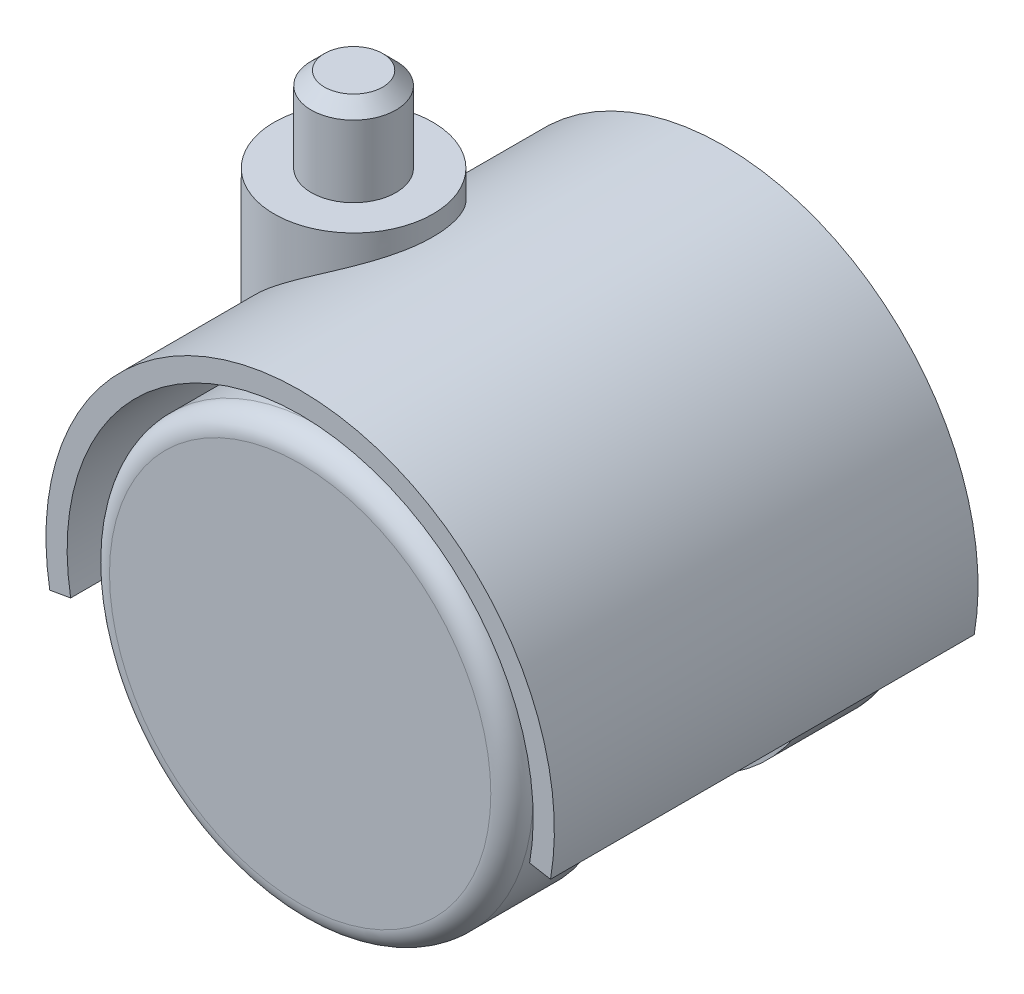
ISO-10303-21;
HEADER;
FILE_DESCRIPTION(('STEP AP214'),'2;1');
FILE_NAME('part.step','',(''),(''),'','','');
FILE_SCHEMA(('AUTOMOTIVE_DESIGN { 1 0 10303 214 1 1 1 1 }'));
ENDSEC;
DATA;
#1=APPLICATION_CONTEXT('core data for automotive mechanical design processes');
#2=APPLICATION_PROTOCOL_DEFINITION('international standard','automotive_design',2000,#1);
#3=PRODUCT_CONTEXT('',#1,'mechanical');
#4=PRODUCT('Part','Part','',(#3));
#5=PRODUCT_RELATED_PRODUCT_CATEGORY('part','',(#4));
#6=PRODUCT_DEFINITION_FORMATION('','',#4);
#7=PRODUCT_DEFINITION_CONTEXT('part definition',#1,'design');
#8=PRODUCT_DEFINITION('design','',#6,#7);
#9=PRODUCT_DEFINITION_SHAPE('','',#8);
#10=(LENGTH_UNIT() NAMED_UNIT(*) SI_UNIT(.MILLI.,.METRE.));
#11=(NAMED_UNIT(*) PLANE_ANGLE_UNIT() SI_UNIT($,.RADIAN.));
#12=(NAMED_UNIT(*) SI_UNIT($,.STERADIAN.) SOLID_ANGLE_UNIT());
#13=UNCERTAINTY_MEASURE_WITH_UNIT(LENGTH_MEASURE(1.E-05),#10,'distance_accuracy_value','');
#14=(GEOMETRIC_REPRESENTATION_CONTEXT(3) GLOBAL_UNCERTAINTY_ASSIGNED_CONTEXT((#13)) GLOBAL_UNIT_ASSIGNED_CONTEXT((#10,
#11,#12)) REPRESENTATION_CONTEXT('',''));
#15=CARTESIAN_POINT('',(0.,0.,0.));
#16=DIRECTION('',(0.,0.,1.));
#17=DIRECTION('',(1.,0.,0.));
#18=AXIS2_PLACEMENT_3D('',#15,#16,#17);
#19=CARTESIAN_POINT('',(0.,0.,0.));
#20=DIRECTION('',(0.,0.,-1.));
#21=DIRECTION('',(-1.,0.,0.));
#22=AXIS2_PLACEMENT_3D('',#19,#20,#21);
#23=CYLINDRICAL_SURFACE('',#22,4.99999999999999);
#24=CARTESIAN_POINT('',(0.,0.,30.));
#25=DIRECTION('',(0.,0.,-1.));
#26=DIRECTION('',(-1.,0.,0.));
#27=AXIS2_PLACEMENT_3D('',#24,#25,#26);
#28=CIRCLE('',#27,4.99999999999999);
#29=CARTESIAN_POINT('',(-4.99999999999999,0.,30.));
#30=VERTEX_POINT('',#29);
#31=EDGE_CURVE('E179',#30,#30,#28,.T.);
#32=ORIENTED_EDGE('',*,*,#31,.T.);
#33=EDGE_LOOP('',(#32));
#34=FACE_BOUND('',#33,.T.);
#35=CARTESIAN_POINT('',(0.,0.,9.99999999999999));
#36=DIRECTION('',(0.,0.,-1.));
#37=DIRECTION('',(-1.,0.,0.));
#38=AXIS2_PLACEMENT_3D('',#35,#36,#37);
#39=CIRCLE('',#38,5.);
#40=CARTESIAN_POINT('',(-5.,0.,9.99999999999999));
#41=VERTEX_POINT('',#40);
#42=EDGE_CURVE('E182',#41,#41,#39,.T.);
#43=ORIENTED_EDGE('',*,*,#42,.F.);
#44=EDGE_LOOP('',(#43));
#45=FACE_BOUND('',#44,.T.);
#46=CARTESIAN_POINT('',(0.,0.,15.));
#47=DIRECTION('',(0.,0.,-1.));
#48=DIRECTION('',(1.,0.,0.));
#49=AXIS2_PLACEMENT_3D('',#46,#47,#48);
#50=CIRCLE('',#49,5.);
#51=CARTESIAN_POINT('',(-4.82962913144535,-1.29409522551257,15.));
#52=VERTEX_POINT('',#51);
#53=CARTESIAN_POINT('',(4.82962913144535,-1.29409522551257,15.));
#54=VERTEX_POINT('',#53);
#55=EDGE_CURVE('E163',#52,#54,#50,.T.);
#56=ORIENTED_EDGE('',*,*,#55,.T.);
#57=DIRECTION('',(0.,0.,1.));
#58=VECTOR('',#57,1.);
#59=CARTESIAN_POINT('',(4.82962913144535,-1.29409522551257,15.));
#60=LINE('',#59,#58);
#61=CARTESIAN_POINT('',(4.82962913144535,-1.29409522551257,25.));
#62=VERTEX_POINT('',#61);
#63=EDGE_CURVE('E58',#54,#62,#60,.T.);
#64=ORIENTED_EDGE('',*,*,#63,.T.);
#65=CARTESIAN_POINT('',(0.,0.,25.));
#66=DIRECTION('',(0.,0.,-1.));
#67=DIRECTION('',(1.,0.,0.));
#68=AXIS2_PLACEMENT_3D('',#65,#66,#67);
#69=CIRCLE('',#68,5.);
#70=CARTESIAN_POINT('',(-4.82962913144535,-1.29409522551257,25.));
#71=VERTEX_POINT('',#70);
#72=EDGE_CURVE('E153',#71,#62,#69,.T.);
#73=ORIENTED_EDGE('',*,*,#72,.F.);
#74=DIRECTION('',(0.,0.,1.));
#75=VECTOR('',#74,1.);
#76=CARTESIAN_POINT('',(-4.82962913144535,-1.29409522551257,15.));
#77=LINE('',#76,#75);
#78=EDGE_CURVE('E174',#52,#71,#77,.T.);
#79=ORIENTED_EDGE('',*,*,#78,.F.);
#80=EDGE_LOOP('',(#56,#64,#73,#79));
#81=FACE_BOUND('',#80,.T.);
#82=ADVANCED_FACE('F35',(#34,#45,#81),#23,.T.);
#83=CARTESIAN_POINT('',(0.,0.,40.));
#84=DIRECTION('',(0.,0.,-1.));
#85=DIRECTION('',(-1.,0.,0.));
#86=AXIS2_PLACEMENT_3D('',#83,#84,#85);
#87=CYLINDRICAL_SURFACE('',#86,20.);
#88=CARTESIAN_POINT('',(0.,0.,2.));
#89=DIRECTION('',(0.,0.,1.));
#90=DIRECTION('',(1.,0.,0.));
#91=AXIS2_PLACEMENT_3D('',#88,#89,#90);
#92=CIRCLE('',#91,20.);
#93=CARTESIAN_POINT('',(20.,0.,2.));
#94=VERTEX_POINT('',#93);
#95=EDGE_CURVE('E188',#94,#94,#92,.T.);
#96=ORIENTED_EDGE('',*,*,#95,.T.);
#97=EDGE_LOOP('',(#96));
#98=FACE_BOUND('',#97,.T.);
#99=CARTESIAN_POINT('',(0.,0.,10.));
#100=DIRECTION('',(0.,0.,-1.));
#101=DIRECTION('',(-1.,0.,0.));
#102=AXIS2_PLACEMENT_3D('',#99,#100,#101);
#103=CIRCLE('',#102,20.);
#104=CARTESIAN_POINT('',(-20.,0.,10.));
#105=VERTEX_POINT('',#104);
#106=EDGE_CURVE('E185',#105,#105,#103,.T.);
#107=ORIENTED_EDGE('',*,*,#106,.T.);
#108=EDGE_LOOP('',(#107));
#109=FACE_BOUND('',#108,.T.);
#110=ADVANCED_FACE('F244',(#98,#109),#87,.T.);
#111=CARTESIAN_POINT('',(0.,0.,0.));
#112=DIRECTION('',(0.,0.,1.));
#113=DIRECTION('',(1.,0.,0.));
#114=AXIS2_PLACEMENT_3D('',#111,#112,#113);
#115=PLANE('',#114);
#116=CARTESIAN_POINT('',(0.,0.,0.));
#117=DIRECTION('',(0.,0.,1.));
#118=DIRECTION('',(1.,0.,0.));
#119=AXIS2_PLACEMENT_3D('',#116,#117,#118);
#120=CIRCLE('',#119,18.);
#121=CARTESIAN_POINT('',(18.,0.,0.));
#122=VERTEX_POINT('',#121);
#123=EDGE_CURVE('E191',#122,#122,#120,.F.);
#124=ORIENTED_EDGE('',*,*,#123,.T.);
#125=EDGE_LOOP('',(#124));
#126=FACE_BOUND('',#125,.T.);
#127=ADVANCED_FACE('F248',(#126),#115,.F.);
#128=CARTESIAN_POINT('',(0.,20.,10.));
#129=DIRECTION('',(0.,0.,-1.));
#130=DIRECTION('',(-1.,0.,0.));
#131=AXIS2_PLACEMENT_3D('',#128,#129,#130);
#132=PLANE('',#131);
#133=ORIENTED_EDGE('',*,*,#106,.F.);
#134=EDGE_LOOP('',(#133));
#135=FACE_BOUND('',#134,.T.);
#136=ORIENTED_EDGE('',*,*,#42,.T.);
#137=EDGE_LOOP('',(#136));
#138=FACE_BOUND('',#137,.T.);
#139=ADVANCED_FACE('F240',(#135,#138),#132,.F.);
#140=CARTESIAN_POINT('',(0.,20.,30.));
#141=DIRECTION('',(0.,0.,1.));
#142=DIRECTION('',(1.,0.,0.));
#143=AXIS2_PLACEMENT_3D('',#140,#141,#142);
#144=PLANE('',#143);
#145=ORIENTED_EDGE('',*,*,#31,.F.);
#146=EDGE_LOOP('',(#145));
#147=FACE_BOUND('',#146,.T.);
#148=CARTESIAN_POINT('',(0.,0.,30.));
#149=DIRECTION('',(0.,0.,-1.));
#150=DIRECTION('',(-1.,0.,0.));
#151=AXIS2_PLACEMENT_3D('',#148,#149,#150);
#152=CIRCLE('',#151,20.);
#153=CARTESIAN_POINT('',(-20.,0.,30.));
#154=VERTEX_POINT('',#153);
#155=EDGE_CURVE('E172',#154,#154,#152,.T.);
#156=ORIENTED_EDGE('',*,*,#155,.T.);
#157=EDGE_LOOP('',(#156));
#158=FACE_BOUND('',#157,.T.);
#159=ADVANCED_FACE('F236',(#147,#158),#144,.F.);
#160=CARTESIAN_POINT('',(0.,0.,40.));
#161=DIRECTION('',(0.,0.,1.));
#162=DIRECTION('',(1.,0.,0.));
#163=AXIS2_PLACEMENT_3D('',#160,#161,#162);
#164=PLANE('',#163);
#165=CARTESIAN_POINT('',(0.,0.,40.));
#166=DIRECTION('',(0.,0.,1.));
#167=DIRECTION('',(1.,0.,0.));
#168=AXIS2_PLACEMENT_3D('',#165,#166,#167);
#169=CIRCLE('',#168,18.);
#170=CARTESIAN_POINT('',(18.,0.,40.));
#171=VERTEX_POINT('',#170);
#172=EDGE_CURVE('E194',#171,#171,#169,.T.);
#173=ORIENTED_EDGE('',*,*,#172,.T.);
#174=EDGE_LOOP('',(#173));
#175=FACE_BOUND('',#174,.T.);
#176=ADVANCED_FACE('F239',(#175),#164,.T.);
#177=CARTESIAN_POINT('',(0.,0.,38.));
#178=DIRECTION('',(0.,0.,1.));
#179=DIRECTION('',(1.,0.,0.));
#180=AXIS2_PLACEMENT_3D('',#177,#178,#179);
#181=CIRCLE('',#180,20.);
#182=CARTESIAN_POINT('',(20.,0.,38.));
#183=VERTEX_POINT('',#182);
#184=EDGE_CURVE('E197',#183,#183,#181,.F.);
#185=ORIENTED_EDGE('',*,*,#184,.T.);
#186=EDGE_LOOP('',(#185));
#187=FACE_BOUND('',#186,.T.);
#188=ORIENTED_EDGE('',*,*,#155,.F.);
#189=EDGE_LOOP('',(#188));
#190=FACE_BOUND('',#189,.T.);
#191=ADVANCED_FACE('F252',(#187,#190),#87,.T.);
#192=CARTESIAN_POINT('',(0.,0.,2.));
#193=DIRECTION('',(0.,0.,1.));
#194=DIRECTION('',(1.,0.,0.));
#195=AXIS2_PLACEMENT_3D('',#192,#193,#194);
#196=TOROIDAL_SURFACE('',#195,18.,2.);
#197=ORIENTED_EDGE('',*,*,#123,.F.);
#198=EDGE_LOOP('',(#197));
#199=FACE_BOUND('',#198,.T.);
#200=ORIENTED_EDGE('',*,*,#95,.F.);
#201=EDGE_LOOP('',(#200));
#202=FACE_BOUND('',#201,.T.);
#203=ADVANCED_FACE('F259',(#199,#202),#196,.T.);
#204=CARTESIAN_POINT('',(0.,0.,38.));
#205=DIRECTION('',(0.,0.,1.));
#206=DIRECTION('',(1.,0.,0.));
#207=AXIS2_PLACEMENT_3D('',#204,#205,#206);
#208=TOROIDAL_SURFACE('',#207,18.,2.);
#209=ORIENTED_EDGE('',*,*,#184,.F.);
#210=EDGE_LOOP('',(#209));
#211=FACE_BOUND('',#210,.T.);
#212=ORIENTED_EDGE('',*,*,#172,.F.);
#213=EDGE_LOOP('',(#212));
#214=FACE_BOUND('',#213,.T.);
#215=ADVANCED_FACE('F232',(#211,#214),#208,.T.);
#216=CARTESIAN_POINT('',(10.3746421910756,19.400175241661,15.));
#217=DIRECTION('',(0.96592582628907,-0.258819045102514,0.));
#218=DIRECTION('',(0.258819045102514,0.96592582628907,0.));
#219=AXIS2_PLACEMENT_3D('',#216,#217,#218);
#220=PLANE('',#219);
#221=DIRECTION('',(0.,0.,1.));
#222=VECTOR('',#221,1.);
#223=CARTESIAN_POINT('',(10.3746421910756,19.400175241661,15.));
#224=LINE('',#223,#222);
#225=CARTESIAN_POINT('',(10.3746421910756,19.400175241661,15.));
#226=VERTEX_POINT('',#225);
#227=CARTESIAN_POINT('',(10.3746421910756,19.400175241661,25.));
#228=VERTEX_POINT('',#227);
#229=EDGE_CURVE('E169',#226,#228,#224,.T.);
#230=ORIENTED_EDGE('',*,*,#229,.T.);
#231=DIRECTION('',(0.258819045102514,0.96592582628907,0.));
#232=VECTOR('',#231,1.);
#233=CARTESIAN_POINT('',(10.3746421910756,19.400175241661,25.));
#234=LINE('',#233,#232);
#235=EDGE_CURVE('E155',#62,#228,#234,.T.);
#236=ORIENTED_EDGE('',*,*,#235,.F.);
#237=ORIENTED_EDGE('',*,*,#63,.F.);
#238=DIRECTION('',(0.258819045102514,0.96592582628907,0.));
#239=VECTOR('',#238,1.);
#240=CARTESIAN_POINT('',(10.3746421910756,19.400175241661,15.));
#241=LINE('',#240,#239);
#242=EDGE_CURVE('E166',#54,#226,#241,.T.);
#243=ORIENTED_EDGE('',*,*,#242,.T.);
#244=EDGE_LOOP('',(#230,#236,#237,#243));
#245=FACE_BOUND('',#244,.T.);
#246=ADVANCED_FACE('F229',(#245),#220,.T.);
#247=CARTESIAN_POINT('',(-10.3746421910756,19.400175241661,15.));
#248=DIRECTION('',(-0.96592582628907,-0.258819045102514,0.));
#249=DIRECTION('',(0.258819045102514,-0.96592582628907,0.));
#250=AXIS2_PLACEMENT_3D('',#247,#248,#249);
#251=PLANE('',#250);
#252=ORIENTED_EDGE('',*,*,#78,.T.);
#253=DIRECTION('',(0.258819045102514,-0.96592582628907,0.));
#254=VECTOR('',#253,1.);
#255=CARTESIAN_POINT('',(-10.3746421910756,19.400175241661,25.));
#256=LINE('',#255,#254);
#257=CARTESIAN_POINT('',(-10.3746421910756,19.400175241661,25.));
#258=VERTEX_POINT('',#257);
#259=EDGE_CURVE('E50',#258,#71,#256,.T.);
#260=ORIENTED_EDGE('',*,*,#259,.F.);
#261=DIRECTION('',(0.,0.,1.));
#262=VECTOR('',#261,1.);
#263=CARTESIAN_POINT('',(-10.3746421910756,19.400175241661,15.));
#264=LINE('',#263,#262);
#265=CARTESIAN_POINT('',(-10.3746421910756,19.400175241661,15.));
#266=VERTEX_POINT('',#265);
#267=EDGE_CURVE('E168',#266,#258,#264,.T.);
#268=ORIENTED_EDGE('',*,*,#267,.F.);
#269=DIRECTION('',(0.258819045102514,-0.96592582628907,0.));
#270=VECTOR('',#269,1.);
#271=CARTESIAN_POINT('',(-10.3746421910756,19.400175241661,15.));
#272=LINE('',#271,#270);
#273=EDGE_CURVE('E160',#266,#52,#272,.T.);
#274=ORIENTED_EDGE('',*,*,#273,.T.);
#275=EDGE_LOOP('',(#252,#260,#268,#274));
#276=FACE_BOUND('',#275,.T.);
#277=ADVANCED_FACE('F227',(#276),#251,.T.);
#278=CARTESIAN_POINT('',(0.,0.,15.));
#279=DIRECTION('',(0.,0.,1.));
#280=DIRECTION('',(1.,0.,0.));
#281=AXIS2_PLACEMENT_3D('',#278,#279,#280);
#282=PLANE('',#281);
#283=CARTESIAN_POINT('',(0.,0.,15.));
#284=DIRECTION('',(0.,0.,1.));
#285=DIRECTION('',(1.,0.,0.));
#286=AXIS2_PLACEMENT_3D('',#283,#284,#285);
#287=CIRCLE('',#286,22.);
#288=EDGE_CURVE('E158',#226,#266,#287,.T.);
#289=ORIENTED_EDGE('',*,*,#288,.F.);
#290=ORIENTED_EDGE('',*,*,#242,.F.);
#291=ORIENTED_EDGE('',*,*,#55,.F.);
#292=ORIENTED_EDGE('',*,*,#273,.F.);
#293=EDGE_LOOP('',(#289,#290,#291,#292));
#294=FACE_BOUND('',#293,.T.);
#295=ADVANCED_FACE('F224',(#294),#282,.F.);
#296=CARTESIAN_POINT('',(0.,0.,25.));
#297=DIRECTION('',(0.,0.,1.));
#298=DIRECTION('',(1.,0.,0.));
#299=AXIS2_PLACEMENT_3D('',#296,#297,#298);
#300=PLANE('',#299);
#301=CARTESIAN_POINT('',(0.,0.,25.));
#302=DIRECTION('',(0.,0.,1.));
#303=DIRECTION('',(1.,0.,0.));
#304=AXIS2_PLACEMENT_3D('',#301,#302,#303);
#305=CIRCLE('',#304,22.);
#306=EDGE_CURVE('E113',#228,#258,#305,.T.);
#307=ORIENTED_EDGE('',*,*,#306,.T.);
#308=ORIENTED_EDGE('',*,*,#259,.T.);
#309=ORIENTED_EDGE('',*,*,#72,.T.);
#310=ORIENTED_EDGE('',*,*,#235,.T.);
#311=EDGE_LOOP('',(#307,#308,#309,#310));
#312=FACE_BOUND('',#311,.T.);
#313=ADVANCED_FACE('F221',(#312),#300,.T.);
#314=CARTESIAN_POINT('',(0.,0.,40.));
#315=DIRECTION('',(0.,0.,-1.));
#316=DIRECTION('',(-1.,0.,0.));
#317=AXIS2_PLACEMENT_3D('',#314,#315,#316);
#318=CYLINDRICAL_SURFACE('',#317,22.);
#319=CARTESIAN_POINT('',(0.,0.,0.));
#320=DIRECTION('',(0.,0.,1.));
#321=DIRECTION('',(1.,0.,0.));
#322=AXIS2_PLACEMENT_3D('',#319,#320,#321);
#323=CIRCLE('',#322,22.);
#324=CARTESIAN_POINT('',(21.6657705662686,-3.82025990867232,0.));
#325=VERTEX_POINT('',#324);
#326=CARTESIAN_POINT('',(-21.6657705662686,-3.82025990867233,0.));
#327=VERTEX_POINT('',#326);
#328=EDGE_CURVE('E127',#325,#327,#323,.T.);
#329=ORIENTED_EDGE('',*,*,#328,.F.);
#330=DIRECTION('',(0.,0.,-1.));
#331=VECTOR('',#330,1.);
#332=CARTESIAN_POINT('',(21.6657705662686,-3.82025990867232,40.));
#333=LINE('',#332,#331);
#334=CARTESIAN_POINT('',(21.6657705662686,-3.82025990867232,40.));
#335=VERTEX_POINT('',#334);
#336=EDGE_CURVE('E140',#335,#325,#333,.T.);
#337=ORIENTED_EDGE('',*,*,#336,.F.);
#338=CARTESIAN_POINT('',(0.,0.,40.));
#339=DIRECTION('',(0.,0.,1.));
#340=DIRECTION('',(1.,0.,0.));
#341=AXIS2_PLACEMENT_3D('',#338,#339,#340);
#342=CIRCLE('',#341,22.);
#343=CARTESIAN_POINT('',(-21.6657705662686,-3.82025990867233,40.));
#344=VERTEX_POINT('',#343);
#345=EDGE_CURVE('E126',#335,#344,#342,.T.);
#346=ORIENTED_EDGE('',*,*,#345,.T.);
#347=DIRECTION('',(0.,0.,-1.));
#348=VECTOR('',#347,1.);
#349=CARTESIAN_POINT('',(-21.6657705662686,-3.82025990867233,40.));
#350=LINE('',#349,#348);
#351=EDGE_CURVE('E148',#344,#327,#350,.T.);
#352=ORIENTED_EDGE('',*,*,#351,.T.);
#353=EDGE_LOOP('',(#329,#337,#346,#352));
#354=FACE_BOUND('',#353,.T.);
#355=ORIENTED_EDGE('',*,*,#288,.T.);
#356=ORIENTED_EDGE('',*,*,#267,.T.);
#357=ORIENTED_EDGE('',*,*,#306,.F.);
#358=ORIENTED_EDGE('',*,*,#229,.F.);
#359=EDGE_LOOP('',(#355,#356,#357,#358));
#360=FACE_BOUND('',#359,.T.);
#361=ADVANCED_FACE('F220',(#354,#360),#318,.F.);
#362=CARTESIAN_POINT('',(0.,1.57169959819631E-13,40.));
#363=DIRECTION('',(-0.173648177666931,-0.984807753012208,0.));
#364=DIRECTION('',(0.984807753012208,-0.173648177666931,0.));
#365=AXIS2_PLACEMENT_3D('',#362,#363,#364);
#366=PLANE('',#365);
#367=DIRECTION('',(-0.984807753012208,0.173648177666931,0.));
#368=VECTOR('',#367,1.);
#369=CARTESIAN_POINT('',(0.,1.57169959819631E-13,0.));
#370=LINE('',#369,#368);
#371=CARTESIAN_POINT('',(23.635386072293,-4.16755626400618,0.));
#372=VERTEX_POINT('',#371);
#373=EDGE_CURVE('E110',#372,#325,#370,.T.);
#374=ORIENTED_EDGE('',*,*,#373,.F.);
#375=DIRECTION('',(0.,0.,-1.));
#376=VECTOR('',#375,1.);
#377=CARTESIAN_POINT('',(23.635386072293,-4.16755626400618,40.));
#378=LINE('',#377,#376);
#379=CARTESIAN_POINT('',(23.635386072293,-4.16755626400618,40.));
#380=VERTEX_POINT('',#379);
#381=EDGE_CURVE('E103',#380,#372,#378,.T.);
#382=ORIENTED_EDGE('',*,*,#381,.F.);
#383=DIRECTION('',(-0.984807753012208,0.173648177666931,0.));
#384=VECTOR('',#383,1.);
#385=CARTESIAN_POINT('',(0.,1.57169959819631E-13,40.));
#386=LINE('',#385,#384);
#387=EDGE_CURVE('E107',#380,#335,#386,.T.);
#388=ORIENTED_EDGE('',*,*,#387,.T.);
#389=ORIENTED_EDGE('',*,*,#336,.T.);
#390=EDGE_LOOP('',(#374,#382,#388,#389));
#391=FACE_BOUND('',#390,.T.);
#392=ADVANCED_FACE('F105',(#391),#366,.T.);
#393=CARTESIAN_POINT('',(0.,0.,40.));
#394=DIRECTION('',(0.,0.,-1.));
#395=DIRECTION('',(-1.,0.,0.));
#396=AXIS2_PLACEMENT_3D('',#393,#394,#395);
#397=CYLINDRICAL_SURFACE('',#396,24.);
#398=CARTESIAN_POINT('',(-14.9549644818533,18.7709625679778,12.5));
#399=CARTESIAN_POINT('',(-14.8611541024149,18.845702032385,12.5000003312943));
#400=CARTESIAN_POINT('',(-14.7667611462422,18.9197159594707,12.5017635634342));
#401=CARTESIAN_POINT('',(-14.5777184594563,19.0656357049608,12.508909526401));
#402=CARTESIAN_POINT('',(-14.4830770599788,19.137553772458,12.5142627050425));
#403=CARTESIAN_POINT('',(-14.2936930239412,19.2792605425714,12.5286195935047));
#404=CARTESIAN_POINT('',(-14.1989575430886,19.3490618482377,12.5375930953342));
#405=CARTESIAN_POINT('',(-14.0095377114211,19.4865140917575,12.5592185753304));
#406=CARTESIAN_POINT('',(-13.9148592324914,19.5541779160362,12.5718399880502));
#407=CARTESIAN_POINT('',(-13.7256999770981,19.6873364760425,12.6007855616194));
#408=CARTESIAN_POINT('',(-13.6312237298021,19.752844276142,12.6170791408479));
#409=CARTESIAN_POINT('',(-13.442610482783,19.8816738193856,12.6533897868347));
#410=CARTESIAN_POINT('',(-13.3484766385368,19.9450086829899,12.6733766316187));
#411=CARTESIAN_POINT('',(-13.1606845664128,20.0694771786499,12.7170911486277));
#412=CARTESIAN_POINT('',(-13.0670281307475,20.130623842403,12.7407893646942));
#413=CARTESIAN_POINT('',(-12.880322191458,20.2507028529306,12.791940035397));
#414=CARTESIAN_POINT('',(-12.7872731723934,20.3096479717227,12.819364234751));
#415=CARTESIAN_POINT('',(-12.6019082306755,20.4253116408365,12.8779784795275));
#416=CARTESIAN_POINT('',(-12.5095915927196,20.4820425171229,12.9091419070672));
#417=CARTESIAN_POINT('',(-12.3258128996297,20.5932709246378,12.9752367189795));
#418=CARTESIAN_POINT('',(-12.2343490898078,20.6477800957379,13.0101436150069));
#419=CARTESIAN_POINT('',(-12.0524066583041,20.7545375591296,13.0837403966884));
#420=CARTESIAN_POINT('',(-11.9619253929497,20.8067969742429,13.122407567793));
#421=CARTESIAN_POINT('',(-11.7822091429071,20.9089945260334,13.2035992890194));
#422=CARTESIAN_POINT('',(-11.6929699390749,20.9589446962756,13.2460993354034));
#423=CARTESIAN_POINT('',(-11.5159537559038,21.056556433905,13.3347976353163));
#424=CARTESIAN_POINT('',(-11.4281711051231,21.1042304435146,13.3809708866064));
#425=CARTESIAN_POINT('',(-11.2542803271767,21.1973042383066,13.4769073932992));
#426=CARTESIAN_POINT('',(-11.1681649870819,21.2427169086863,13.5266450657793));
#427=CARTESIAN_POINT('',(-10.9978101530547,21.331288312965,13.6295913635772));
#428=CARTESIAN_POINT('',(-10.9135618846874,21.3744602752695,13.6827740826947));
#429=CARTESIAN_POINT('',(-10.747134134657,21.4585697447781,13.7924967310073));
#430=CARTESIAN_POINT('',(-10.6649443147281,21.4995207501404,13.8490106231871));
#431=CARTESIAN_POINT('',(-10.5028174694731,21.5792087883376,13.965282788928));
#432=CARTESIAN_POINT('',(-10.4228685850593,21.6179594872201,14.0250151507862));
#433=CARTESIAN_POINT('',(-10.2653990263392,21.6932678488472,14.1476135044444));
#434=CARTESIAN_POINT('',(-10.1878650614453,21.7298392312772,14.2104539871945));
#435=CARTESIAN_POINT('',(-10.0353920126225,21.8008107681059,14.3391592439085));
#436=CARTESIAN_POINT('',(-9.96043835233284,21.8352245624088,14.4049992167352));
#437=CARTESIAN_POINT('',(-9.8132847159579,21.9019025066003,14.5395966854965));
#438=CARTESIAN_POINT('',(-9.74106907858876,21.9341800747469,14.6083304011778));
#439=CARTESIAN_POINT('',(-9.59953966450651,21.9966108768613,14.748606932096));
#440=CARTESIAN_POINT('',(-9.53020942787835,22.0267771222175,14.8201273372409));
#441=CARTESIAN_POINT('',(-9.39459998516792,22.0849993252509,14.9658814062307));
#442=CARTESIAN_POINT('',(-9.32830376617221,22.1130678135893,15.0400942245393));
#443=CARTESIAN_POINT('',(-9.19893750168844,22.1672122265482,15.1910867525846));
#444=CARTESIAN_POINT('',(-9.13584938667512,22.1932998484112,15.2678467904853));
#445=CARTESIAN_POINT('',(-9.01295284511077,22.2435434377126,15.4236815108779));
#446=CARTESIAN_POINT('',(-8.95312547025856,22.2677110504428,15.5027375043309));
#447=CARTESIAN_POINT('',(-8.83682303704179,22.31417949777,15.662939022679));
#448=CARTESIAN_POINT('',(-8.78032786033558,22.3364919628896,15.7440665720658));
#449=CARTESIAN_POINT('',(-8.6707511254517,22.37931199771,15.9081887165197));
#450=CARTESIAN_POINT('',(-8.61764823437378,22.399831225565,15.9911660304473));
#451=CARTESIAN_POINT('',(-8.51491406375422,22.4391256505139,16.1587742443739));
#452=CARTESIAN_POINT('',(-8.46526017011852,22.457912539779,16.2433885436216));
#453=CARTESIAN_POINT('',(-8.36947664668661,22.493801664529,16.4140643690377));
#454=CARTESIAN_POINT('',(-8.32332310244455,22.5109156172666,16.5001100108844));
#455=CARTESIAN_POINT('',(-8.23458817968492,22.543516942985,16.6734495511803));
#456=CARTESIAN_POINT('',(-8.19198159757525,22.5590160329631,16.7607283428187));
#457=CARTESIAN_POINT('',(-8.11038379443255,22.5884443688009,16.9363423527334));
#458=CARTESIAN_POINT('',(-8.07136612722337,22.6023852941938,17.0246633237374));
#459=CARTESIAN_POINT('',(-7.99698427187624,22.6287528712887,17.2021767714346));
#460=CARTESIAN_POINT('',(-7.96159248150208,22.6411911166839,17.2913559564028));
#461=CARTESIAN_POINT('',(-7.89449721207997,22.6646072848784,17.4704080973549));
#462=CARTESIAN_POINT('',(-7.86276508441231,22.6755966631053,17.5602688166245));
#463=CARTESIAN_POINT('',(-7.80301433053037,22.6961692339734,17.7405117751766));
#464=CARTESIAN_POINT('',(-7.77496621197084,22.7057636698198,17.8308829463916));
#465=CARTESIAN_POINT('',(-7.72262013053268,22.7235950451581,18.0119946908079));
#466=CARTESIAN_POINT('',(-7.69829221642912,22.7318428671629,18.1027255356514));
#467=CARTESIAN_POINT('',(-7.65330042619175,22.7470897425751,18.2844213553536));
#468=CARTESIAN_POINT('',(-7.63260888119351,22.7540982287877,18.3753786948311));
#469=CARTESIAN_POINT('',(-7.59480358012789,22.7668890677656,18.5573671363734));
#470=CARTESIAN_POINT('',(-7.57766289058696,22.7726806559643,18.6483919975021));
#471=CARTESIAN_POINT('',(-7.54688394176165,22.7830695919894,18.8303549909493));
#472=CARTESIAN_POINT('',(-7.53321900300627,22.7876760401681,18.921288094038));
#473=CARTESIAN_POINT('',(-7.50931469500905,22.7957234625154,19.1029139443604));
#474=CARTESIAN_POINT('',(-7.49904882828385,22.7991734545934,19.1936028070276));
#475=CARTESIAN_POINT('',(-7.48186686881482,22.8049371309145,19.374593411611));
#476=CARTESIAN_POINT('',(-7.47492439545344,22.8072597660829,19.4648923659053));
#477=CARTESIAN_POINT('',(-7.46431378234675,22.8107973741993,19.6449630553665));
#478=CARTESIAN_POINT('',(-7.46061934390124,22.8120212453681,19.7347330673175));
#479=CARTESIAN_POINT('',(-7.45642987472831,22.8133897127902,19.913612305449));
#480=CARTESIAN_POINT('',(-7.45590861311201,22.8135431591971,20.0027208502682));
#481=CARTESIAN_POINT('',(-7.45799102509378,22.8127988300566,20.1801499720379));
#482=CARTESIAN_POINT('',(-7.46056854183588,22.8119098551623,20.2684708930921));
#483=CARTESIAN_POINT('',(-7.46877446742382,22.8091085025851,20.4442038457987));
#484=CARTESIAN_POINT('',(-7.47437681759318,22.8072048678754,20.5316172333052));
#485=CARTESIAN_POINT('',(-7.48855885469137,22.8024015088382,20.7054202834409));
#486=CARTESIAN_POINT('',(-7.49711262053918,22.7995104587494,20.7918123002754));
#487=CARTESIAN_POINT('',(-7.5171241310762,22.7927600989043,20.9634638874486));
#488=CARTESIAN_POINT('',(-7.52855614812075,22.7889093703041,21.0487267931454));
#489=CARTESIAN_POINT('',(-7.55425201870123,22.7802642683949,21.2180168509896));
#490=CARTESIAN_POINT('',(-7.56849039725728,22.7754783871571,21.302048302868));
#491=CARTESIAN_POINT('',(-7.59972434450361,22.7649981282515,21.468779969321));
#492=CARTESIAN_POINT('',(-7.6166948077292,22.7593120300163,21.5514854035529));
#493=CARTESIAN_POINT('',(-7.6533349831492,22.7470220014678,21.7154854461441));
#494=CARTESIAN_POINT('',(-7.6729805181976,22.7404262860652,21.7967860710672));
#495=CARTESIAN_POINT('',(-7.71483309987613,22.7263155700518,21.9579079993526));
#496=CARTESIAN_POINT('',(-7.7370171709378,22.7188087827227,22.0377359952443));
#497=CARTESIAN_POINT('',(-7.78381101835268,22.7028901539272,22.1958409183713));
#498=CARTESIAN_POINT('',(-7.80839854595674,22.6944865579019,22.27412526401));
#499=CARTESIAN_POINT('',(-7.85986781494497,22.6767851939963,22.4290753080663));
#500=CARTESIAN_POINT('',(-7.88672793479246,22.6674957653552,22.5057491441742));
#501=CARTESIAN_POINT('',(-7.94261485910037,22.6480351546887,22.6574153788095));
#502=CARTESIAN_POINT('',(-7.9716205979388,22.6378724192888,22.7324166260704));
#503=CARTESIAN_POINT('',(-8.03167515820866,22.6166778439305,22.8806793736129));
#504=CARTESIAN_POINT('',(-8.06270342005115,22.6056545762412,22.9539504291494));
#505=CARTESIAN_POINT('',(-8.12668323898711,22.5827521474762,23.0986989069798));
#506=CARTESIAN_POINT('',(-8.15961471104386,22.5708816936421,23.1701865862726));
#507=CARTESIAN_POINT('',(-8.2272848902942,22.5462985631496,23.3113187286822));
#508=CARTESIAN_POINT('',(-8.26200397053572,22.5335947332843,23.3809741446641));
#509=CARTESIAN_POINT('',(-8.33313694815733,22.5073589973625,23.518396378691));
#510=CARTESIAN_POINT('',(-8.36953167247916,22.493836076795,23.5861748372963));
#511=CARTESIAN_POINT('',(-8.44390706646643,22.4659767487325,23.7198018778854));
#512=CARTESIAN_POINT('',(-8.48186902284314,22.4516494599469,23.785662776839));
#513=CARTESIAN_POINT('',(-8.55927351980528,22.4221964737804,23.9154174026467));
#514=CARTESIAN_POINT('',(-8.59869782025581,22.4070800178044,23.9793241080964));
#515=CARTESIAN_POINT('',(-8.67892490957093,22.3760640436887,24.1051370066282));
#516=CARTESIAN_POINT('',(-8.71970995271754,22.3601738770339,24.1670568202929));
#517=CARTESIAN_POINT('',(-8.80256023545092,22.3276268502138,24.2888661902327));
#518=CARTESIAN_POINT('',(-8.84460824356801,22.3109794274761,24.348769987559));
#519=CARTESIAN_POINT('',(-8.92988763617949,22.2769324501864,24.466522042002));
#520=CARTESIAN_POINT('',(-8.97310234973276,22.2595424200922,24.5243851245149));
#521=CARTESIAN_POINT('',(-9.0606280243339,22.2240333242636,24.63803128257));
#522=CARTESIAN_POINT('',(-9.1049228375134,22.2059237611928,24.6938297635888));
#523=CARTESIAN_POINT('',(-9.19449335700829,22.1689720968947,24.8033271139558));
#524=CARTESIAN_POINT('',(-9.2397534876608,22.1501399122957,24.8570420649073));
#525=CARTESIAN_POINT('',(-9.3311181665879,22.1117610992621,24.9623957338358));
#526=CARTESIAN_POINT('',(-9.37720828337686,22.0922244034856,25.0140506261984));
#527=CARTESIAN_POINT('',(-9.51584740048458,22.0329168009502,25.1651322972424));
#528=CARTESIAN_POINT('',(-9.61019638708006,21.9918592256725,25.2624191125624));
#529=CARTESIAN_POINT('',(-9.80112389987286,21.9072426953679,25.449004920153));
#530=CARTESIAN_POINT('',(-9.89761137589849,21.8637561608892,25.5384303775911));
#531=CARTESIAN_POINT('',(-10.0921010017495,21.7745211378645,25.7095720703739));
#532=CARTESIAN_POINT('',(-10.1900249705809,21.7288421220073,25.7914134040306));
#533=CARTESIAN_POINT('',(-10.3867270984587,21.6354554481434,25.9476583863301));
#534=CARTESIAN_POINT('',(-10.4854383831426,21.5878150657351,26.0221865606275));
#535=CARTESIAN_POINT('',(-10.6831188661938,21.4907295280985,26.1640840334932));
#536=CARTESIAN_POINT('',(-10.7820311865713,21.4413500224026,26.2315775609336));
#537=CARTESIAN_POINT('',(-10.9795755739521,21.3410020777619,26.3596856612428));
#538=CARTESIAN_POINT('',(-11.0781598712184,21.2900980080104,26.4204243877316));
#539=CARTESIAN_POINT('',(-11.2745620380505,21.1869089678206,26.5353117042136));
#540=CARTESIAN_POINT('',(-11.3723406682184,21.1346872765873,26.589584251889));
#541=CARTESIAN_POINT('',(-11.5667076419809,21.0290631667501,26.6918099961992));
#542=CARTESIAN_POINT('',(-11.663264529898,20.9757230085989,26.7398873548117));
#543=CARTESIAN_POINT('',(-11.8548891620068,20.8679915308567,26.8301236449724));
#544=CARTESIAN_POINT('',(-11.9499348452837,20.813658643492,26.8723993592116));
#545=CARTESIAN_POINT('',(-12.1383111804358,20.7041757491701,26.951556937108));
#546=CARTESIAN_POINT('',(-12.2316275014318,20.6490775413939,26.9885447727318));
#547=CARTESIAN_POINT('',(-12.4162989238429,20.5383211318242,27.0575220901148));
#548=CARTESIAN_POINT('',(-12.5076450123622,20.4827110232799,27.089613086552));
#549=CARTESIAN_POINT('',(-12.6881546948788,20.3711693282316,27.1491859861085));
#550=CARTESIAN_POINT('',(-12.7773140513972,20.3152827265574,27.176765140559));
#551=CARTESIAN_POINT('',(-12.953261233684,20.2034087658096,27.2276795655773));
#552=CARTESIAN_POINT('',(-13.0400489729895,20.1474637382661,27.2511083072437));
#553=CARTESIAN_POINT('',(-13.2110911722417,20.0356771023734,27.294068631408));
#554=CARTESIAN_POINT('',(-13.2953492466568,19.979875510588,27.3136901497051));
#555=CARTESIAN_POINT('',(-13.4611980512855,19.8685636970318,27.3493648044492));
#556=CARTESIAN_POINT('',(-13.5427956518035,19.8130914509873,27.3655045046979));
#557=CARTESIAN_POINT('',(-13.7032088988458,19.7026131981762,27.394524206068));
#558=CARTESIAN_POINT('',(-13.7820344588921,19.6476432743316,27.4074875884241));
#559=CARTESIAN_POINT('',(-14.0104894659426,19.4863036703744,27.441385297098));
#560=CARTESIAN_POINT('',(-14.1596026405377,19.3784614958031,27.4589087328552));
#561=CARTESIAN_POINT('',(-14.4458162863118,19.1662447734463,27.4839200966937));
#562=CARTESIAN_POINT('',(-14.5830527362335,19.0621213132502,27.4920012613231));
#563=CARTESIAN_POINT('',(-14.84591632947,18.8579913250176,27.5002848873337));
#564=CARTESIAN_POINT('',(-14.9716917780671,18.7581955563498,27.5009919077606));
#565=CARTESIAN_POINT('',(-15.2120795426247,18.5634879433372,27.496394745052));
#566=CARTESIAN_POINT('',(-15.3268395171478,18.468747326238,27.4915231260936));
#567=CARTESIAN_POINT('',(-15.5454135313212,18.2848886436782,27.4772831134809));
#568=CARTESIAN_POINT('',(-15.6493763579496,18.1959173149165,27.4683001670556));
#569=CARTESIAN_POINT('',(-15.8466310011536,18.024217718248,27.4471682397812));
#570=CARTESIAN_POINT('',(-15.9400687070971,17.9416142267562,27.4353598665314));
#571=CARTESIAN_POINT('',(-16.1915962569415,17.7158084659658,27.3988238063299));
#572=CARTESIAN_POINT('',(-16.3482044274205,17.5714572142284,27.3708921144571));
#573=CARTESIAN_POINT('',(-16.6221773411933,17.3122206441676,27.3131883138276));
#574=CARTESIAN_POINT('',(-16.7405052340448,17.1979430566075,27.285215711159));
#575=CARTESIAN_POINT('',(-16.9406150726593,17.0006719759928,27.2328121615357));
#576=CARTESIAN_POINT('',(-17.0231505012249,16.9181004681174,27.2096643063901));
#577=CARTESIAN_POINT('',(-17.1539201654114,16.7853182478,27.1705679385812));
#578=CARTESIAN_POINT('',(-17.2026711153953,16.735372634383,27.1554426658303));
#579=CARTESIAN_POINT('',(-17.2674304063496,16.6684255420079,27.1346193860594));
#580=CARTESIAN_POINT('',(-17.2837024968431,16.6515524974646,27.1293247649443));
#581=CARTESIAN_POINT('',(-17.4603111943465,16.467872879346,27.0711903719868));
#582=CARTESIAN_POINT('',(-17.6174604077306,16.2995033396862,27.0134467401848));
#583=CARTESIAN_POINT('',(-17.9256906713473,15.9596901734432,26.8885257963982));
#584=CARTESIAN_POINT('',(-18.0767502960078,15.7882383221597,26.8213183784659));
#585=CARTESIAN_POINT('',(-18.3724416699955,15.4430457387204,26.678057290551));
#586=CARTESIAN_POINT('',(-18.5170641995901,15.2693021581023,26.6019914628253));
#587=CARTESIAN_POINT('',(-18.7995056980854,14.920328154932,26.4416392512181));
#588=CARTESIAN_POINT('',(-18.9373294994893,14.7450988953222,26.357358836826));
#589=CARTESIAN_POINT('',(-19.205746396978,14.3939675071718,26.1810935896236));
#590=CARTESIAN_POINT('',(-19.3363601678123,14.2180690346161,26.0891329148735));
#591=CARTESIAN_POINT('',(-19.5904030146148,13.8659932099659,25.8982261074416));
#592=CARTESIAN_POINT('',(-19.7138554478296,13.6898189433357,25.7993053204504));
#593=CARTESIAN_POINT('',(-19.9539184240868,13.3374271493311,25.5942604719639));
#594=CARTESIAN_POINT('',(-20.0705380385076,13.1612100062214,25.4881463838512));
#595=CARTESIAN_POINT('',(-20.2970524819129,12.8091146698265,25.2682236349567));
#596=CARTESIAN_POINT('',(-20.4069443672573,12.6332366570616,25.1544116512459));
#597=CARTESIAN_POINT('',(-20.6201664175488,12.2821176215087,24.9187677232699));
#598=CARTESIAN_POINT('',(-20.7234805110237,12.1068790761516,24.7969175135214));
#599=CARTESIAN_POINT('',(-20.9236945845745,11.7575921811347,24.5445263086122));
#600=CARTESIAN_POINT('',(-21.0205643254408,11.5835524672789,24.4139494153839));
#601=CARTESIAN_POINT('',(-21.2076762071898,11.2369576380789,24.1452291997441));
#602=CARTESIAN_POINT('',(-21.297901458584,11.0644072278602,24.0070680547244));
#603=CARTESIAN_POINT('',(-21.4712513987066,10.7234408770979,23.7211689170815));
#604=CARTESIAN_POINT('',(-21.5543726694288,10.5550269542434,23.5734263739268));
#605=CARTESIAN_POINT('',(-21.6673758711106,10.319926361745,23.353844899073));
#606=CARTESIAN_POINT('',(-21.7005061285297,10.250172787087,23.2869472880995));
#607=CARTESIAN_POINT('',(-21.7652675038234,10.1126520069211,23.1506830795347));
#608=CARTESIAN_POINT('',(-21.7969010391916,10.0448816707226,23.0813208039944));
#609=CARTESIAN_POINT('',(-21.8348939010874,9.96182363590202,22.9942741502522));
#610=CARTESIAN_POINT('',(-21.8421254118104,9.94593655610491,22.9775306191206));
#611=CARTESIAN_POINT('',(-21.8685223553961,9.88778646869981,22.9157603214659));
#612=CARTESIAN_POINT('',(-21.8874098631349,9.84586965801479,22.8702861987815));
#613=CARTESIAN_POINT('',(-21.9361030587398,9.73703338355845,22.7495205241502));
#614=CARTESIAN_POINT('',(-21.9653602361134,9.67084901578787,22.673344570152));
#615=CARTESIAN_POINT('',(-22.0328885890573,9.51628466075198,22.4881564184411));
#616=CARTESIAN_POINT('',(-22.0703031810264,9.42914895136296,22.3777749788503));
#617=CARTESIAN_POINT('',(-22.118101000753,9.31616927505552,22.2250667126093));
#618=CARTESIAN_POINT('',(-22.1301822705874,9.28745609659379,22.1853661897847));
#619=CARTESIAN_POINT('',(-22.1593550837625,9.21776990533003,22.0866555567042));
#620=CARTESIAN_POINT('',(-22.1761746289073,9.17728022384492,22.0272210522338));
#621=CARTESIAN_POINT('',(-22.2025652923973,9.11319074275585,21.9297614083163));
#622=CARTESIAN_POINT('',(-22.212459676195,9.08902550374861,21.892193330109));
#623=CARTESIAN_POINT('',(-22.2330483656,9.03850939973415,21.8114346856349));
#624=CARTESIAN_POINT('',(-22.2436790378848,9.01228373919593,21.7681490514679));
#625=CARTESIAN_POINT('',(-22.2654999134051,8.9582010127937,21.6756277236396));
#626=CARTESIAN_POINT('',(-22.2766137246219,8.93050351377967,21.6262805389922));
#627=CARTESIAN_POINT('',(-22.2991143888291,8.87415505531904,21.521346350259));
#628=CARTESIAN_POINT('',(-22.3104130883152,8.84569589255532,21.4656370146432));
#629=CARTESIAN_POINT('',(-22.3316780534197,8.79186911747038,21.3542164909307));
#630=CARTESIAN_POINT('',(-22.3416701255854,8.76644296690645,21.2985385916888));
#631=CARTESIAN_POINT('',(-22.3606940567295,8.71781777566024,21.1851106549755));
#632=CARTESIAN_POINT('',(-22.3697105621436,8.69465478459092,21.1273425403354));
#633=CARTESIAN_POINT('',(-22.38664982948,8.65095975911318,21.0097420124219));
#634=CARTESIAN_POINT('',(-22.3945560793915,8.63046771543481,20.9498922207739));
#635=CARTESIAN_POINT('',(-22.4054495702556,8.60212808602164,20.858914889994));
#636=CARTESIAN_POINT('',(-22.4089350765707,8.5930410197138,20.8282283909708));
#637=CARTESIAN_POINT('',(-22.4155763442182,8.57569481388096,20.7663472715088));
#638=CARTESIAN_POINT('',(-22.4187295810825,8.56744202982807,20.7351505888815));
#639=CARTESIAN_POINT('',(-22.4246871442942,8.55182304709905,20.67225380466));
#640=CARTESIAN_POINT('',(-22.427488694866,8.54446391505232,20.6405516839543));
#641=CARTESIAN_POINT('',(-22.4327233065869,8.53069248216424,20.5766476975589));
#642=CARTESIAN_POINT('',(-22.4351532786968,8.52428812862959,20.5444438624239));
#643=CARTESIAN_POINT('',(-22.4396250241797,8.51248690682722,20.4795409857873));
#644=CARTESIAN_POINT('',(-22.441663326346,8.50709905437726,20.446840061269));
#645=CARTESIAN_POINT('',(-22.4453299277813,8.49739864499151,20.3809473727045));
#646=CARTESIAN_POINT('',(-22.4469542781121,8.49309644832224,20.3477538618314));
#647=CARTESIAN_POINT('',(-22.4497766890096,8.48561635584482,20.2808838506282));
#648=CARTESIAN_POINT('',(-22.4509703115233,8.48245016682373,20.247205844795));
#649=CARTESIAN_POINT('',(-22.4528865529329,8.47738479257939,20.1795140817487));
#650=CARTESIAN_POINT('',(-22.4536059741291,8.47549420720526,20.1454995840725));
#651=CARTESIAN_POINT('',(-22.4545603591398,8.47301480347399,20.0772566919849));
#652=CARTESIAN_POINT('',(-22.454793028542,8.47243214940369,20.0430280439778));
#653=CARTESIAN_POINT('',(-22.4547776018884,8.47254909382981,19.9743868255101));
#654=CARTESIAN_POINT('',(-22.4545268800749,8.47325569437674,19.9399742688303));
#655=CARTESIAN_POINT('',(-22.4536073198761,8.47577201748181,19.8753331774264));
#656=CARTESIAN_POINT('',(-22.4529922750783,8.47743916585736,19.8450981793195));
#657=CARTESIAN_POINT('',(-22.4513959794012,8.48173838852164,19.7845326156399));
#658=CARTESIAN_POINT('',(-22.4504126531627,8.48437592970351,19.7542024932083));
#659=CARTESIAN_POINT('',(-22.4480812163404,8.49060624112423,19.6934692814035));
#660=CARTESIAN_POINT('',(-22.4467309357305,8.49420469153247,19.6630668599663));
#661=CARTESIAN_POINT('',(-22.4436672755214,8.50234618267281,19.6022120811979));
#662=CARTESIAN_POINT('',(-22.4419516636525,8.50689502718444,19.5717606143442));
#663=CARTESIAN_POINT('',(-22.4381592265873,8.51692593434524,19.510831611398));
#664=CARTESIAN_POINT('',(-22.4360801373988,8.52241384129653,19.4803551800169));
#665=CARTESIAN_POINT('',(-22.4315628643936,8.53431066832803,19.4194009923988));
#666=CARTESIAN_POINT('',(-22.4291224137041,8.54072539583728,19.3889245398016));
#667=CARTESIAN_POINT('',(-22.4238847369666,8.55446289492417,19.327995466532));
#668=CARTESIAN_POINT('',(-22.4210852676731,8.56179136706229,19.297544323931));
#669=CARTESIAN_POINT('',(-22.4151322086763,8.57734231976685,19.2366933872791));
#670=CARTESIAN_POINT('',(-22.4119764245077,8.58557032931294,19.2062952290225));
#671=CARTESIAN_POINT('',(-22.4019508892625,8.61165432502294,19.1149311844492));
#672=CARTESIAN_POINT('',(-22.3945731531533,8.63077835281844,19.0543776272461));
#673=CARTESIAN_POINT('',(-22.3784453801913,8.67239797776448,18.9338113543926));
#674=CARTESIAN_POINT('',(-22.3696799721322,8.6949311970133,18.8738137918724));
#675=CARTESIAN_POINT('',(-22.3508127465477,8.74320454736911,18.7545804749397));
#676=CARTESIAN_POINT('',(-22.3406977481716,8.76897613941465,18.6953595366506));
#677=CARTESIAN_POINT('',(-22.3191354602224,8.82366526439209,18.5779883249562));
#678=CARTESIAN_POINT('',(-22.3076771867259,8.85260858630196,18.5198521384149));
#679=CARTESIAN_POINT('',(-22.2848146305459,8.90998413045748,18.410539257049));
#680=CARTESIAN_POINT('',(-22.27350958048,8.93820145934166,18.3592279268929));
#681=CARTESIAN_POINT('',(-22.250078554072,8.99632590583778,18.2577846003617));
#682=CARTESIAN_POINT('',(-22.237952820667,9.02623252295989,18.2076522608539));
#683=CARTESIAN_POINT('',(-22.2129116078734,9.08762011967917,18.1085420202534));
#684=CARTESIAN_POINT('',(-22.1999958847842,9.11910158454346,18.0595644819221));
#685=CARTESIAN_POINT('',(-22.1734137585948,9.18349683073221,17.9627204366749));
#686=CARTESIAN_POINT('',(-22.159746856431,9.21641156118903,17.9148546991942));
#687=CARTESIAN_POINT('',(-22.1316989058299,9.2835395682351,17.8201961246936));
#688=CARTESIAN_POINT('',(-22.1173172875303,9.31775387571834,17.7734041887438));
#689=CARTESIAN_POINT('',(-22.0878773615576,9.387343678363,17.6808542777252));
#690=CARTESIAN_POINT('',(-22.0728185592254,9.42272001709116,17.6350970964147));
#691=CARTESIAN_POINT('',(-22.0266774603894,9.53040294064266,17.4993100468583));
#692=CARTESIAN_POINT('',(-21.9946431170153,9.60423308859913,17.410807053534));
#693=CARTESIAN_POINT('',(-21.9283181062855,9.75487819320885,17.2374596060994));
#694=CARTESIAN_POINT('',(-21.894029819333,9.83168996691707,17.1526114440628));
#695=CARTESIAN_POINT('',(-21.8233471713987,9.98762974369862,16.9861231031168));
#696=CARTESIAN_POINT('',(-21.7869545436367,10.0667558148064,16.9044803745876));
#697=CARTESIAN_POINT('',(-21.7121113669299,10.2271167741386,16.7442047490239));
#698=CARTESIAN_POINT('',(-21.6736600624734,10.3083524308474,16.6655729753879));
#699=CARTESIAN_POINT('',(-21.5948002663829,10.4725323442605,16.5111405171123));
#700=CARTESIAN_POINT('',(-21.5543918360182,10.5554765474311,16.4353397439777));
#701=CARTESIAN_POINT('',(-21.430462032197,10.8061493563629,16.2121039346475));
#702=CARTESIAN_POINT('',(-21.3441161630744,10.9759762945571,16.0685808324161));
#703=CARTESIAN_POINT('',(-21.1643541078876,11.3186777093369,15.7903626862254));
#704=CARTESIAN_POINT('',(-21.0709454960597,11.4915487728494,15.6556584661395));
#705=CARTESIAN_POINT('',(-20.8770854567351,11.8397311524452,15.3944942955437));
#706=CARTESIAN_POINT('',(-20.7766302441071,12.0150437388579,15.2680388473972));
#707=CARTESIAN_POINT('',(-20.5689261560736,12.3670646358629,15.0232339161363));
#708=CARTESIAN_POINT('',(-20.4616819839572,12.5437719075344,14.9048789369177));
#709=CARTESIAN_POINT('',(-20.240642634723,12.8975367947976,14.6761122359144));
#710=CARTESIAN_POINT('',(-20.1268620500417,13.074592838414,14.5656839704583));
#711=CARTESIAN_POINT('',(-19.8929773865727,13.4280253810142,14.3526656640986));
#712=CARTESIAN_POINT('',(-19.7728990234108,13.6044019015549,14.2500473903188));
#713=CARTESIAN_POINT('',(-19.5257328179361,13.9567579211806,14.0515640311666));
#714=CARTESIAN_POINT('',(-19.3986298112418,14.1327356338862,13.9557146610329));
#715=CARTESIAN_POINT('',(-19.1374663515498,14.4839733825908,13.7712203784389));
#716=CARTESIAN_POINT('',(-19.003392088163,14.6592311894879,13.6825907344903));
#717=CARTESIAN_POINT('',(-18.7283887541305,15.0085812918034,13.5132521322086));
#718=CARTESIAN_POINT('',(-18.5874517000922,15.1826719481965,13.432552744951));
#719=CARTESIAN_POINT('',(-18.2988425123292,15.5292556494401,13.2797465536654));
#720=CARTESIAN_POINT('',(-18.1511664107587,15.7017476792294,13.2076449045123));
#721=CARTESIAN_POINT('',(-17.9246960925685,15.9588750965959,13.1064540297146));
#722=CARTESIAN_POINT('',(-17.8483675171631,16.0443291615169,13.0738794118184));
#723=CARTESIAN_POINT('',(-17.6941126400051,16.21471112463,13.0111490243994));
#724=CARTESIAN_POINT('',(-17.6161861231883,16.2996389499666,12.9809935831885));
#725=CARTESIAN_POINT('',(-17.5047904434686,16.4190958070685,12.940092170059));
#726=CARTESIAN_POINT('',(-17.4720552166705,16.4539670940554,12.9283364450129));
#727=CARTESIAN_POINT('',(-17.3832942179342,16.5479017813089,12.8971795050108));
#728=CARTESIAN_POINT('',(-17.3269872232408,16.6068325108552,12.8781796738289));
#729=CARTESIAN_POINT('',(-17.1414475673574,16.7990453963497,12.8181062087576));
#730=CARTESIAN_POINT('',(-17.0105446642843,16.9315671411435,12.7796914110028));
#731=CARTESIAN_POINT('',(-16.7908584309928,17.1488344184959,12.7219459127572));
#732=CARTESIAN_POINT('',(-16.7032130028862,17.2342091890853,12.7006171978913));
#733=CARTESIAN_POINT('',(-16.5123835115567,17.4172674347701,12.6579230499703));
#734=CARTESIAN_POINT('',(-16.4089189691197,17.5147805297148,12.6370768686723));
#735=CARTESIAN_POINT('',(-16.1633644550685,17.7421183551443,12.5931073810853));
#736=CARTESIAN_POINT('',(-16.0203981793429,17.8713406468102,12.5717291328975));
#737=CARTESIAN_POINT('',(-15.7532487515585,18.1070010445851,12.5397418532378));
#738=CARTESIAN_POINT('',(-15.6295827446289,18.2138703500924,12.5279782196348));
#739=CARTESIAN_POINT('',(-15.4027645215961,18.4058326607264,12.5120216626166));
#740=CARTESIAN_POINT('',(-15.3000159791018,18.4913203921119,12.5068351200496));
#741=CARTESIAN_POINT('',(-15.1164396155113,18.6414768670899,12.5012301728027));
#742=CARTESIAN_POINT('',(-15.0359101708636,18.7064810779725,12.4999986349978));
#743=CARTESIAN_POINT('',(-14.9549644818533,18.7709625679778,12.5));
#744=B_SPLINE_CURVE_WITH_KNOTS('',3,(#398,#399,#400,#401,#402,#403,#404,#405,#406,#407,#408,
#409,#410,#411,#412,#413,#414,#415,#416,#417,#418,#419,#420,#421,#422,#423,#424,#425,#426,#427,
#428,#429,#430,#431,#432,#433,#434,#435,#436,#437,#438,#439,#440,#441,#442,#443,#444,#445,#446,
#447,#448,#449,#450,#451,#452,#453,#454,#455,#456,#457,#458,#459,#460,#461,#462,#463,#464,#465,
#466,#467,#468,#469,#470,#471,#472,#473,#474,#475,#476,#477,#478,#479,#480,#481,#482,#483,#484,
#485,#486,#487,#488,#489,#490,#491,#492,#493,#494,#495,#496,#497,#498,#499,#500,#501,#502,#503,
#504,#505,#506,#507,#508,#509,#510,#511,#512,#513,#514,#515,#516,#517,#518,#519,#520,#521,#522,
#523,#524,#525,#526,#527,#528,#529,#530,#531,#532,#533,#534,#535,#536,#537,#538,#539,#540,#541,
#542,#543,#544,#545,#546,#547,#548,#549,#550,#551,#552,#553,#554,#555,#556,#557,#558,#559,#560,
#561,#562,#563,#564,#565,#566,#567,#568,#569,#570,#571,#572,#573,#574,#575,#576,#577,#578,#579,
#580,#581,#582,#583,#584,#585,#586,#587,#588,#589,#590,#591,#592,#593,#594,#595,#596,#597,#598,
#599,#600,#601,#602,#603,#604,#605,#606,#607,#608,#609,#610,#611,#612,#613,#614,#615,#616,#617,
#618,#619,#620,#621,#622,#623,#624,#625,#626,#627,#628,#629,#630,#631,#632,#633,#634,#635,#636,
#637,#638,#639,#640,#641,#642,#643,#644,#645,#646,#647,#648,#649,#650,#651,#652,#653,#654,#655,
#656,#657,#658,#659,#660,#661,#662,#663,#664,#665,#666,#667,#668,#669,#670,#671,#672,#673,#674,
#675,#676,#677,#678,#679,#680,#681,#682,#683,#684,#685,#686,#687,#688,#689,#690,#691,#692,#693,
#694,#695,#696,#697,#698,#699,#700,#701,#702,#703,#704,#705,#706,#707,#708,#709,#710,#711,#712,
#713,#714,#715,#716,#717,#718,#719,#720,#721,#722,#723,#724,#725,#726,#727,#728,#729,#730,#731,
#732,#733,#734,#735,#736,#737,#738,#739,#740,#741,#742,#743),.UNSPECIFIED.,.F.,.F.,(4,2,2,2,2,2,
2,2,2,2,2,2,2,2,2,2,2,2,2,2,2,2,2,2,2,2,2,2,2,2,2,2,2,2,2,2,2,2,2,2,2,2,2,2,2,2,2,2,2,2,2,2,2,2,
2,2,2,2,2,2,2,2,2,2,2,2,2,2,2,2,2,2,2,2,2,2,2,2,2,2,2,2,2,2,2,2,2,2,2,2,2,2,2,2,2,2,2,2,2,2,2,2,
2,2,2,2,2,2,2,2,2,2,2,2,2,2,2,2,2,2,2,2,2,2,2,2,2,2,2,2,2,2,2,2,2,2,2,2,2,2,2,2,2,2,2,2,2,2,2,2,
2,2,2,2,2,2,2,2,2,2,2,2,2,2,2,2,2,2,2,2,2,2,4),(0.,0.359818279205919,0.716710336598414,
1.07068411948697,1.42177395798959,1.77004142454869,2.11557599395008,2.45849548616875,
2.79894627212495,3.13710322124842,3.47316936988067,3.80731854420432,4.13946534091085,
4.46951830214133,4.7974025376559,5.12305685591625,5.44643710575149,5.76751914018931,
6.08630141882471,6.40280725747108,6.7170867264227,7.0292181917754,7.33930474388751,
7.64738877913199,7.95343310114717,8.25738558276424,8.55918650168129,8.85877293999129,
9.15608273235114,9.45105799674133,9.74364827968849,10.0338133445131,10.3215256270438,
10.6067723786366,10.889585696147,11.1701439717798,11.448489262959,11.7246287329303,
11.9985618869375,12.270282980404,12.539783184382,12.8070525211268,13.0720815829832,
13.334863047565,13.5953930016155,13.8536720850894,14.1097064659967,14.3635099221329,
14.6151554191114,14.8646807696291,15.1120827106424,15.357350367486,15.6004672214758,
15.841412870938,16.0801645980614,16.3166987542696,16.5509919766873,16.7830222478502,
17.0127698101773,17.2402179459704,17.4653536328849,17.6881680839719,17.9086571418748,
18.1267859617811,18.3425550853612,18.7671113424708,19.1825732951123,19.589028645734,
19.9864880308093,20.3749118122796,20.7542315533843,21.1243668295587,21.4852386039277,
21.8372040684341,22.1806310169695,22.5155078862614,22.8417791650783,23.1593601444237,
23.4681488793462,23.7680357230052,24.0589107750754,24.6131640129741,25.1303168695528,
25.6118318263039,26.058398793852,26.4697040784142,26.8454721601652,27.4895885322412,
27.9900634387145,28.3470832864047,28.561316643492,28.6334113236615,29.3453854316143,
30.0596778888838,30.7749624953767,31.4897311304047,32.2023305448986,32.9124573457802,
33.6216189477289,34.3310886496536,35.0422300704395,35.7565021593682,36.4725312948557,
37.1889030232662,37.4953625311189,37.8013088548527,37.8738717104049,38.0678493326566,
38.3829779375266,38.8192051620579,38.9705856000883,39.1921018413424,39.3293461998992,
39.4844638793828,39.6574322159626,39.8480758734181,40.0340624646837,40.2226456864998,
40.4137893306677,40.5103553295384,40.607608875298,40.7055872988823,40.8043404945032,
40.9039321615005,41.0044410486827,41.1059578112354,41.2081523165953,41.3108274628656,
41.414061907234,41.504906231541,41.5962703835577,41.6881870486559,41.7806823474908,
41.8737757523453,41.9674800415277,42.0618012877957,42.1567388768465,42.348407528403,
42.5423707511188,42.7383899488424,42.9361414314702,43.115018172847,43.2938421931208,
43.4727216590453,43.6517214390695,43.8308663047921,44.0101442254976,44.3688607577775,
44.7272043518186,45.0852568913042,45.4434417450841,45.8016153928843,46.5168189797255,
47.2312661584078,47.9461000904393,48.660444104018,49.3732510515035,50.0833450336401,
50.7950368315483,51.5081966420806,52.2222068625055,52.9366430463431,53.293973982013,
53.6513533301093,53.7991081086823,54.0501724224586,54.6205455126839,54.9930986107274,
55.4241025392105,56.0055510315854,56.4970171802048,56.8982234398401,57.2086839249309),.UNSPECIFIED.);
#745=CARTESIAN_POINT('',(-14.9549644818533,18.7709625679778,12.5));
#746=VERTEX_POINT('',#745);
#747=EDGE_CURVE('E143',#746,#746,#744,.F.);
#748=ORIENTED_EDGE('',*,*,#747,.T.);
#749=EDGE_LOOP('',(#748));
#750=FACE_BOUND('',#749,.T.);
#751=CARTESIAN_POINT('',(0.,0.,0.));
#752=DIRECTION('',(0.,0.,1.));
#753=DIRECTION('',(1.,0.,0.));
#754=AXIS2_PLACEMENT_3D('',#751,#752,#753);
#755=CIRCLE('',#754,24.);
#756=CARTESIAN_POINT('',(-23.635386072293,-4.16755626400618,0.));
#757=VERTEX_POINT('',#756);
#758=EDGE_CURVE('E142',#372,#757,#755,.T.);
#759=ORIENTED_EDGE('',*,*,#758,.T.);
#760=DIRECTION('',(0.,0.,-1.));
#761=VECTOR('',#760,1.);
#762=CARTESIAN_POINT('',(-23.635386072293,-4.16755626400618,40.));
#763=LINE('',#762,#761);
#764=CARTESIAN_POINT('',(-23.635386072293,-4.16755626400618,40.));
#765=VERTEX_POINT('',#764);
#766=EDGE_CURVE('E114',#765,#757,#763,.T.);
#767=ORIENTED_EDGE('',*,*,#766,.F.);
#768=CARTESIAN_POINT('',(0.,0.,40.));
#769=DIRECTION('',(0.,0.,1.));
#770=DIRECTION('',(1.,0.,0.));
#771=AXIS2_PLACEMENT_3D('',#768,#769,#770);
#772=CIRCLE('',#771,24.);
#773=EDGE_CURVE('E117',#380,#765,#772,.T.);
#774=ORIENTED_EDGE('',*,*,#773,.F.);
#775=ORIENTED_EDGE('',*,*,#381,.T.);
#776=EDGE_LOOP('',(#759,#767,#774,#775));
#777=FACE_BOUND('',#776,.T.);
#778=ADVANCED_FACE('F118',(#750,#777),#397,.T.);
#779=CARTESIAN_POINT('',(0.,0.,40.));
#780=DIRECTION('',(-0.173648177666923,0.984807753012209,0.));
#781=DIRECTION('',(-0.984807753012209,-0.173648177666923,0.));
#782=AXIS2_PLACEMENT_3D('',#779,#780,#781);
#783=PLANE('',#782);
#784=DIRECTION('',(0.984807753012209,0.173648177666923,0.));
#785=VECTOR('',#784,1.);
#786=CARTESIAN_POINT('',(0.,0.,0.));
#787=LINE('',#786,#785);
#788=EDGE_CURVE('E130',#757,#327,#787,.T.);
#789=ORIENTED_EDGE('',*,*,#788,.T.);
#790=ORIENTED_EDGE('',*,*,#351,.F.);
#791=DIRECTION('',(0.984807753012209,0.173648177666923,0.));
#792=VECTOR('',#791,1.);
#793=CARTESIAN_POINT('',(0.,0.,40.));
#794=LINE('',#793,#792);
#795=EDGE_CURVE('E122',#765,#344,#794,.T.);
#796=ORIENTED_EDGE('',*,*,#795,.F.);
#797=ORIENTED_EDGE('',*,*,#766,.T.);
#798=EDGE_LOOP('',(#789,#790,#796,#797));
#799=FACE_BOUND('',#798,.T.);
#800=ADVANCED_FACE('F216',(#799),#783,.F.);
#801=CARTESIAN_POINT('',(0.,0.,40.));
#802=DIRECTION('',(0.,0.,1.));
#803=DIRECTION('',(1.,0.,0.));
#804=AXIS2_PLACEMENT_3D('',#801,#802,#803);
#805=PLANE('',#804);
#806=ORIENTED_EDGE('',*,*,#387,.F.);
#807=ORIENTED_EDGE('',*,*,#773,.T.);
#808=ORIENTED_EDGE('',*,*,#795,.T.);
#809=ORIENTED_EDGE('',*,*,#345,.F.);
#810=EDGE_LOOP('',(#806,#807,#808,#809));
#811=FACE_BOUND('',#810,.T.);
#812=ADVANCED_FACE('F124',(#811),#805,.T.);
#813=CARTESIAN_POINT('',(0.,0.,0.));
#814=DIRECTION('',(0.,0.,1.));
#815=DIRECTION('',(1.,0.,0.));
#816=AXIS2_PLACEMENT_3D('',#813,#814,#815);
#817=PLANE('',#816);
#818=ORIENTED_EDGE('',*,*,#373,.T.);
#819=ORIENTED_EDGE('',*,*,#328,.T.);
#820=ORIENTED_EDGE('',*,*,#788,.F.);
#821=ORIENTED_EDGE('',*,*,#758,.F.);
#822=EDGE_LOOP('',(#818,#819,#820,#821));
#823=FACE_BOUND('',#822,.T.);
#824=ADVANCED_FACE('F320',(#823),#817,.F.);
#825=CARTESIAN_POINT('',(-14.9549644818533,18.7709626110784,12.5));
#826=CARTESIAN_POINT('',(-16.8378170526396,17.2708800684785,12.5));
#827=CARTESIAN_POINT('',(-18.4264896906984,15.5270576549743,13.1657221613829));
#828=CARTESIAN_POINT('',(-20.2767194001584,12.8845221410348,14.656205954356));
#829=CARTESIAN_POINT('',(-20.8173221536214,11.9823138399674,15.2489800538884));
#830=CARTESIAN_POINT('',(-21.4902677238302,10.6959141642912,16.2970054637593));
#831=CARTESIAN_POINT('',(-21.693525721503,10.2748980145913,16.6761049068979));
#832=CARTESIAN_POINT('',(-22.0455349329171,9.49615590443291,17.5139797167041));
#833=CARTESIAN_POINT('',(-22.1963375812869,9.13271473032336,17.9755782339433));
#834=CARTESIAN_POINT('',(-22.4102606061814,8.59442260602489,19.023103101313));
#835=CARTESIAN_POINT('',(-22.4695774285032,8.43330764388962,19.6244727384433));
#836=CARTESIAN_POINT('',(-22.4336263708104,8.52848142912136,20.8246482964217));
#837=CARTESIAN_POINT('',(-22.3432489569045,8.76886945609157,21.3866252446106));
#838=CARTESIAN_POINT('',(-21.9602383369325,9.70583917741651,22.8660157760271));
#839=CARTESIAN_POINT('',(-21.5685904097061,10.5719581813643,23.6304444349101));
#840=CARTESIAN_POINT('',(-20.6296424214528,12.3039930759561,24.9717406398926));
#841=CARTESIAN_POINT('',(-20.0816599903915,13.1871816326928,25.5313779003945));
#842=CARTESIAN_POINT('',(-18.8112067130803,14.9436718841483,26.4813998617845));
#843=CARTESIAN_POINT('',(-18.0820754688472,15.8230151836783,26.8687236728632));
#844=CARTESIAN_POINT('',(-16.4820657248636,17.4834428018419,27.3909505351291));
#845=CARTESIAN_POINT('',(-15.5876237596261,18.2874586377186,27.5321242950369));
#846=CARTESIAN_POINT('',(-13.7096664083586,19.7344927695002,27.4553596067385));
#847=CARTESIAN_POINT('',(-12.7053110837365,20.3906389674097,27.2324527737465));
#848=CARTESIAN_POINT('',(-10.7924364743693,21.4645382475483,26.3279281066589));
#849=CARTESIAN_POINT('',(-9.87587240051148,21.8881388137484,25.6378112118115));
#850=CARTESIAN_POINT('',(-8.41582397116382,22.489939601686,23.8499003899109));
#851=CARTESIAN_POINT('',(-7.87814136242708,22.6716938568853,22.7535381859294));
#852=CARTESIAN_POINT('',(-7.37350568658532,22.8408018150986,20.4299773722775));
#853=CARTESIAN_POINT('',(-7.40381103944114,22.8317614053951,19.2006102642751));
#854=CARTESIAN_POINT('',(-8.01969603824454,22.6227810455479,16.9079143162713));
#855=CARTESIAN_POINT('',(-8.60948604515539,22.4181141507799,15.8403161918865));
#856=CARTESIAN_POINT('',(-10.1443938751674,21.7666342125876,14.132592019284));
#857=CARTESIAN_POINT('',(-11.0853360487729,21.3159471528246,13.4900920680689));
#858=CARTESIAN_POINT('',(-13.0222321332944,20.1909818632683,12.6776048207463));
#859=CARTESIAN_POINT('',(-14.0135381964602,19.5210038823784,12.5));
#860=CARTESIAN_POINT('',(-14.9549644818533,18.7709626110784,12.5));
#861=B_SPLINE_CURVE_WITH_KNOTS('',3,(#825,#826,#827,#828,#829,#830,#831,#832,#833,#834,#835,
#836,#837,#838,#839,#840,#841,#842,#843,#844,#845,#846,#847,#848,#849,#850,#851,#852,#853,#854,
#855,#856,#857,#858,#859,#860),.UNSPECIFIED.,.T.,.F.,(4,2,2,2,2,2,2,2,2,2,2,2,2,2,2,2,2,4),(0.,
0.125,0.1875,0.21875,0.25,0.28125,0.3125,0.375,0.4375,0.5,0.5625,0.625,0.6875,0.75,0.8125,0.875,
0.9375,1.),.UNSPECIFIED.);
#862=DIRECTION('',(0.,1.,0.));
#863=VECTOR('',#862,1.);
#864=SURFACE_OF_LINEAR_EXTRUSION('',#861,#863);
#865=CARTESIAN_POINT('',(-14.9549644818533,24.6788212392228,12.5));
#866=CARTESIAN_POINT('',(-14.8498861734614,24.6788212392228,12.5000309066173));
#867=CARTESIAN_POINT('',(-14.7448017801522,24.6788212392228,12.5022214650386));
#868=CARTESIAN_POINT('',(-14.5348225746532,24.6788212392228,12.5110404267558));
#869=CARTESIAN_POINT('',(-14.4299277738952,24.6788212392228,12.5176690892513));
#870=CARTESIAN_POINT('',(-14.1157651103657,24.6788212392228,12.5441483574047));
#871=CARTESIAN_POINT('',(-13.9070113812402,24.6788212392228,12.570592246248));
#872=CARTESIAN_POINT('',(-13.4923540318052,24.6788212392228,12.6409407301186));
#873=CARTESIAN_POINT('',(-13.2864524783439,24.6788212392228,12.6848573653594));
#874=CARTESIAN_POINT('',(-12.8790513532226,24.6788212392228,12.7898805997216));
#875=CARTESIAN_POINT('',(-12.6775516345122,24.6788212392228,12.8509866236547));
#876=CARTESIAN_POINT('',(-12.3797707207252,24.6788212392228,12.9551590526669));
#877=CARTESIAN_POINT('',(-12.2812576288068,24.6788212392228,12.9919676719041));
#878=CARTESIAN_POINT('',(-12.0858623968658,24.6788212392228,13.0696843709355));
#879=CARTESIAN_POINT('',(-11.9889802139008,24.6788212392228,13.110592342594));
#880=CARTESIAN_POINT('',(-11.7011326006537,24.6788212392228,13.239527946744));
#881=CARTESIAN_POINT('',(-11.5129202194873,24.6788212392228,13.3337832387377));
#882=CARTESIAN_POINT('',(-11.1450389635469,24.6788212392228,13.5376360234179));
#883=CARTESIAN_POINT('',(-10.9653693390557,24.6788212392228,13.6472321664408));
#884=CARTESIAN_POINT('',(-10.6157460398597,24.6788212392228,13.8808582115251));
#885=CARTESIAN_POINT('',(-10.4457933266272,24.6788212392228,14.0048895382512));
#886=CARTESIAN_POINT('',(-9.95028935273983,24.6788212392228,14.399120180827));
#887=CARTESIAN_POINT('',(-9.64090366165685,24.6788212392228,14.6904518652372));
#888=CARTESIAN_POINT('',(-9.21863794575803,24.6788212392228,15.1638467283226));
#889=CARTESIAN_POINT('',(-9.08480458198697,24.6788212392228,15.3277869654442));
#890=CARTESIAN_POINT('',(-8.83145431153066,24.6788212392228,15.6664890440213));
#891=CARTESIAN_POINT('',(-8.71193967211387,24.6788212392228,15.8412525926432));
#892=CARTESIAN_POINT('',(-8.48892400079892,24.6788212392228,16.1983229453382));
#893=CARTESIAN_POINT('',(-8.38527833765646,24.6788212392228,16.3805397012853));
#894=CARTESIAN_POINT('',(-8.19327756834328,24.6788212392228,16.7528429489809));
#895=CARTESIAN_POINT('',(-8.10492140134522,24.6788212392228,16.9429288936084));
#896=CARTESIAN_POINT('',(-7.94427715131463,24.6788212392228,17.3298225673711));
#897=CARTESIAN_POINT('',(-7.87198975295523,24.6788212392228,17.5266305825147));
#898=CARTESIAN_POINT('',(-7.77635248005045,24.6788212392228,17.825877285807));
#899=CARTESIAN_POINT('',(-7.74660372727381,24.6788212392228,17.9263072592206));
#900=CARTESIAN_POINT('',(-7.69148221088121,24.6788212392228,18.1283611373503));
#901=CARTESIAN_POINT('',(-7.66610947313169,24.6788212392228,18.22998504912));
#902=CARTESIAN_POINT('',(-7.59615595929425,24.6788212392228,18.5378709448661));
#903=CARTESIAN_POINT('',(-7.55820822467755,24.6788212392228,18.7456778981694));
#904=CARTESIAN_POINT('',(-7.49988807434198,24.6788212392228,19.1637337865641));
#905=CARTESIAN_POINT('',(-7.47951793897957,24.6788212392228,19.3739830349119));
#906=CARTESIAN_POINT('',(-7.45632344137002,24.6788212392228,19.7954619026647));
#907=CARTESIAN_POINT('',(-7.45349963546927,24.6788212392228,20.0066915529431));
#908=CARTESIAN_POINT('',(-7.46544911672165,24.6788212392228,20.4286301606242));
#909=CARTESIAN_POINT('',(-7.48022116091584,24.6788212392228,20.6393391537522));
#910=CARTESIAN_POINT('',(-7.52760755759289,24.6788212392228,21.0600353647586));
#911=CARTESIAN_POINT('',(-7.56032607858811,24.6788212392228,21.270011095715));
#912=CARTESIAN_POINT('',(-7.62297150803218,24.6788212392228,21.5821961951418));
#913=CARTESIAN_POINT('',(-7.64611749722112,24.6788212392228,21.6858047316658));
#914=CARTESIAN_POINT('',(-7.69690697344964,24.6788212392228,21.8919138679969));
#915=CARTESIAN_POINT('',(-7.72455049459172,24.6788212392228,21.9944144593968));
#916=CARTESIAN_POINT('',(-7.81401978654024,24.6788212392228,22.2999720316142));
#917=CARTESIAN_POINT('',(-7.88239708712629,24.6788212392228,22.501148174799));
#918=CARTESIAN_POINT('',(-8.03576526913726,24.6788212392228,22.8970584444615));
#919=CARTESIAN_POINT('',(-8.12075835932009,24.6788212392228,23.091791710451));
#920=CARTESIAN_POINT('',(-8.30562057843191,24.6788212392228,23.4714383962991));
#921=CARTESIAN_POINT('',(-8.40531748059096,24.6788212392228,23.6564357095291));
#922=CARTESIAN_POINT('',(-8.61969479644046,24.6788212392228,24.0175379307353));
#923=CARTESIAN_POINT('',(-8.7343729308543,24.6788212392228,24.1936441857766));
#924=CARTESIAN_POINT('',(-8.91723303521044,24.6788212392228,24.4500138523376));
#925=CARTESIAN_POINT('',(-8.98000132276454,24.6788212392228,24.5341812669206));
#926=CARTESIAN_POINT('',(-9.10912674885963,24.6788212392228,24.699716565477));
#927=CARTESIAN_POINT('',(-9.17548385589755,24.6788212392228,24.7810844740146));
#928=CARTESIAN_POINT('',(-9.37969633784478,24.6788212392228,25.0208036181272));
#929=CARTESIAN_POINT('',(-9.5227141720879,24.6788212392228,25.1748001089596));
#930=CARTESIAN_POINT('',(-9.82113164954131,24.6788212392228,25.4702409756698));
#931=CARTESIAN_POINT('',(-9.976530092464,24.6788212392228,25.6116865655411));
#932=CARTESIAN_POINT('',(-10.2984219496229,24.6788212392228,25.8812031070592));
#933=CARTESIAN_POINT('',(-10.4649161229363,24.6788212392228,26.0092731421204));
#934=CARTESIAN_POINT('',(-10.9795817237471,24.6788212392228,26.3723008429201));
#935=CARTESIAN_POINT('',(-11.34318887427,24.6788212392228,26.5863254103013));
#936=CARTESIAN_POINT('',(-11.8173351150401,24.6788212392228,26.8129900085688));
#937=CARTESIAN_POINT('',(-11.9138867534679,24.6788212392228,26.8565822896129));
#938=CARTESIAN_POINT('',(-12.1087568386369,24.6788212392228,26.9396064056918));
#939=CARTESIAN_POINT('',(-12.2070748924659,24.6788212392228,26.9790391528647));
#940=CARTESIAN_POINT('',(-12.5043470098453,24.6788212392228,27.0909917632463));
#941=CARTESIAN_POINT('',(-12.7057100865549,24.6788212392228,27.1572094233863));
#942=CARTESIAN_POINT('',(-13.1132895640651,24.6788212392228,27.2725472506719));
#943=CARTESIAN_POINT('',(-13.3195071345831,24.6788212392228,27.3216632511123));
#944=CARTESIAN_POINT('',(-13.7353419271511,24.6788212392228,27.4024828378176));
#945=CARTESIAN_POINT('',(-13.9449587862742,24.6788212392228,27.4341882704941));
#946=CARTESIAN_POINT('',(-14.2605766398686,24.6788212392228,27.4683308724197));
#947=CARTESIAN_POINT('',(-14.3658895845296,24.6788212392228,27.4774736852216));
#948=CARTESIAN_POINT('',(-14.5768105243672,24.6788212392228,27.4912052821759));
#949=CARTESIAN_POINT('',(-14.6824185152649,24.6788212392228,27.4957941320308));
#950=CARTESIAN_POINT('',(-14.9993916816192,24.6788212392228,27.5028207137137));
#951=CARTESIAN_POINT('',(-15.2109439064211,24.6788212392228,27.4985225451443));
#952=CARTESIAN_POINT('',(-15.6328824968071,24.6788212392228,27.4720890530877));
#953=CARTESIAN_POINT('',(-15.843268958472,24.6788212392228,27.4499552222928));
#954=CARTESIAN_POINT('',(-16.2614452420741,24.6788212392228,27.3880904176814));
#955=CARTESIAN_POINT('',(-16.4692350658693,24.6788212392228,27.3483594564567));
#956=CARTESIAN_POINT('',(-16.8798294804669,24.6788212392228,27.2517383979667));
#957=CARTESIAN_POINT('',(-17.0826518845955,24.6788212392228,27.1949240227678));
#958=CARTESIAN_POINT('',(-17.4827547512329,24.6788212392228,27.0643370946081));
#959=CARTESIAN_POINT('',(-17.6800354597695,24.6788212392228,26.9905652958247));
#960=CARTESIAN_POINT('',(-18.0676857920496,24.6788212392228,26.8267247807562));
#961=CARTESIAN_POINT('',(-18.2580557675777,24.6788212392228,26.7366568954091));
#962=CARTESIAN_POINT('',(-18.6306031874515,24.6788212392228,26.5408333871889));
#963=CARTESIAN_POINT('',(-18.8127798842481,24.6788212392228,26.4350763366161));
#964=CARTESIAN_POINT('',(-19.0789931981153,24.6788212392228,26.2652163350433));
#965=CARTESIAN_POINT('',(-19.166623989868,24.6788212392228,26.2066734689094));
#966=CARTESIAN_POINT('',(-19.3393230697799,24.6788212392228,26.0859092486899));
#967=CARTESIAN_POINT('',(-19.4243912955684,24.6788212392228,26.0236878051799));
#968=CARTESIAN_POINT('',(-19.5919054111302,24.6788212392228,25.895838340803));
#969=CARTESIAN_POINT('',(-19.6743517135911,24.6788212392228,25.8302108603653));
#970=CARTESIAN_POINT('',(-19.8364292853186,24.6788212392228,25.6955773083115));
#971=CARTESIAN_POINT('',(-19.916060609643,24.6788212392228,25.6265713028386));
#972=CARTESIAN_POINT('',(-20.1504328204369,24.6788212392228,25.4145270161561));
#973=CARTESIAN_POINT('',(-20.3006701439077,24.6788212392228,25.2664486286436));
#974=CARTESIAN_POINT('',(-20.5878076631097,24.6788212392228,24.9578351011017));
#975=CARTESIAN_POINT('',(-20.7247050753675,24.6788212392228,24.7972973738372));
#976=CARTESIAN_POINT('',(-20.9193129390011,24.6788212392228,24.5487123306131));
#977=CARTESIAN_POINT('',(-20.9822784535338,24.6788212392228,24.4647280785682));
#978=CARTESIAN_POINT('',(-21.0741262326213,24.6788212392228,24.3368818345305));
#979=CARTESIAN_POINT('',(-21.1043099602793,24.6788212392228,24.2939529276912));
#980=CARTESIAN_POINT('',(-21.1638712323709,24.6788212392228,24.2075390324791));
#981=CARTESIAN_POINT('',(-21.1932487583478,24.6788212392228,24.1640540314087));
#982=CARTESIAN_POINT('',(-21.2800788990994,24.6788212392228,24.0327626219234));
#983=CARTESIAN_POINT('',(-21.3362445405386,24.6788212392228,23.9440983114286));
#984=CARTESIAN_POINT('',(-21.4448017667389,24.6788212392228,23.7644955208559));
#985=CARTESIAN_POINT('',(-21.4971935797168,24.6788212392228,23.6735571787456));
#986=CARTESIAN_POINT('',(-21.5979599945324,24.6788212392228,23.489467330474));
#987=CARTESIAN_POINT('',(-21.6463342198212,24.6788212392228,23.3963156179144));
#988=CARTESIAN_POINT('',(-21.7388960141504,24.6788212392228,23.2079556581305));
#989=CARTESIAN_POINT('',(-21.7830836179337,24.6788212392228,23.1127474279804));
#990=CARTESIAN_POINT('',(-21.8672070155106,24.6788212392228,22.9204585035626));
#991=CARTESIAN_POINT('',(-21.9071423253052,24.6788212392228,22.8233775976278));
#992=CARTESIAN_POINT('',(-21.9827697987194,24.6788212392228,22.6275767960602));
#993=CARTESIAN_POINT('',(-22.0184618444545,24.6788212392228,22.5288568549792));
#994=CARTESIAN_POINT('',(-22.0856013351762,24.6788212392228,22.3302948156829));
#995=CARTESIAN_POINT('',(-22.1170605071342,24.6788212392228,22.230456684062));
#996=CARTESIAN_POINT('',(-22.1612467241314,24.6788212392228,22.0798276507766));
#997=CARTESIAN_POINT('',(-22.1754752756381,24.6788212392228,22.0294717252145));
#998=CARTESIAN_POINT('',(-22.2029806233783,24.6788212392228,21.9285006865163));
#999=CARTESIAN_POINT('',(-22.2162574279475,24.6788212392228,21.8778855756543));
#1000=CARTESIAN_POINT('',(-22.2544666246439,24.6788212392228,21.7256322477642));
#1001=CARTESIAN_POINT('',(-22.277778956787,24.6788212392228,21.6235821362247));
#1002=CARTESIAN_POINT('',(-22.3201246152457,24.6788212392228,21.4186037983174));
#1003=CARTESIAN_POINT('',(-22.3391579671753,24.6788212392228,21.3156755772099));
#1004=CARTESIAN_POINT('',(-22.3729596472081,24.6788212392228,21.1090911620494));
#1005=CARTESIAN_POINT('',(-22.3877268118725,24.6788212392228,21.0054347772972));
#1006=CARTESIAN_POINT('',(-22.4129506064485,24.6788212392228,20.7975980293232));
#1007=CARTESIAN_POINT('',(-22.4234071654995,24.6788212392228,20.6934176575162));
#1008=CARTESIAN_POINT('',(-22.4399536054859,24.6788212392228,20.4847061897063));
#1009=CARTESIAN_POINT('',(-22.4460434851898,24.6788212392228,20.3801750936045));
#1010=CARTESIAN_POINT('',(-22.4518238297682,24.6788212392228,20.2232624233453));
#1011=CARTESIAN_POINT('',(-22.453191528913,24.6788212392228,20.1709383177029));
#1012=CARTESIAN_POINT('',(-22.454765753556,24.6788212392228,20.0662726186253));
#1013=CARTESIAN_POINT('',(-22.4549722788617,24.6788212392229,20.0139310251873));
#1014=CARTESIAN_POINT('',(-22.4539140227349,24.6788212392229,19.8554392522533));
#1015=CARTESIAN_POINT('',(-22.4509181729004,24.6788212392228,19.749296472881));
#1016=CARTESIAN_POINT('',(-22.4405349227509,24.6788212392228,19.5372236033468));
#1017=CARTESIAN_POINT('',(-22.4331472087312,24.6788212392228,19.4312935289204));
#1018=CARTESIAN_POINT('',(-22.4140613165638,24.6788212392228,19.2198163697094));
#1019=CARTESIAN_POINT('',(-22.4023628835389,24.6788212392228,19.1142693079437));
#1020=CARTESIAN_POINT('',(-22.3746173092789,24.6788212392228,18.9037496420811));
#1021=CARTESIAN_POINT('',(-22.3585704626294,24.6788212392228,18.7987769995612));
#1022=CARTESIAN_POINT('',(-22.3310734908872,24.6788212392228,18.6419235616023));
#1023=CARTESIAN_POINT('',(-22.3213364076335,24.6788212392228,18.5897386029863));
#1024=CARTESIAN_POINT('',(-22.3006912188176,24.6788212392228,18.4856006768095));
#1025=CARTESIAN_POINT('',(-22.2897830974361,24.6788212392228,18.4336477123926));
#1026=CARTESIAN_POINT('',(-22.2554578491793,24.6788212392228,18.2781399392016));
#1027=CARTESIAN_POINT('',(-22.2304393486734,24.6788212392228,18.1749334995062));
#1028=CARTESIAN_POINT('',(-22.1759922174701,24.6788212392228,17.9696989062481));
#1029=CARTESIAN_POINT('',(-22.1465638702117,24.6788212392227,17.8676706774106));
#1030=CARTESIAN_POINT('',(-22.0833278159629,24.6788212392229,17.664982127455));
#1031=CARTESIAN_POINT('',(-22.0495202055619,24.678821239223,17.564321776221));
#1032=CARTESIAN_POINT('',(-21.9777636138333,24.678821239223,17.3649521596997));
#1033=CARTESIAN_POINT('',(-21.9398320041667,24.6788212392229,17.2662366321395));
#1034=CARTESIAN_POINT('',(-21.8599384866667,24.6788212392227,17.0704485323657));
#1035=CARTESIAN_POINT('',(-21.8179765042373,24.6788212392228,16.9733759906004));
#1036=CARTESIAN_POINT('',(-21.7299858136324,24.6788212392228,16.781080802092));
#1037=CARTESIAN_POINT('',(-21.6839567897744,24.6788212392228,16.6858582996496));
#1038=CARTESIAN_POINT('',(-21.5878775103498,24.6788212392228,16.4974667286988));
#1039=CARTESIAN_POINT('',(-21.5378273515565,24.6788212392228,16.4042976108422));
#1040=CARTESIAN_POINT('',(-21.4338032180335,24.6788212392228,16.2201875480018));
#1041=CARTESIAN_POINT('',(-21.3798295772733,24.6788212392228,16.1292464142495));
#1042=CARTESIAN_POINT('',(-21.2681358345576,24.6788212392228,15.9496931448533));
#1043=CARTESIAN_POINT('',(-21.2104156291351,24.6788212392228,15.861081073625));
#1044=CARTESIAN_POINT('',(-21.0913402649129,24.6788212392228,15.6863402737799));
#1045=CARTESIAN_POINT('',(-21.0299853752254,24.6788212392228,15.6002113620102));
#1046=CARTESIAN_POINT('',(-20.9036898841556,24.6788212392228,15.4306343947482));
#1047=CARTESIAN_POINT('',(-20.8387493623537,24.6788212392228,15.3471862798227));
#1048=CARTESIAN_POINT('',(-20.6386192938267,24.6788212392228,15.1010566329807));
#1049=CARTESIAN_POINT('',(-20.498143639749,24.6788212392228,14.9426227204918));
#1050=CARTESIAN_POINT('',(-20.2041556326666,24.6788212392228,14.6383422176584));
#1051=CARTESIAN_POINT('',(-20.0506425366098,24.6788212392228,14.4924963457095));
#1052=CARTESIAN_POINT('',(-19.8115947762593,24.6788212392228,14.2838010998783));
#1053=CARTESIAN_POINT('',(-19.7304228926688,24.6788212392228,14.2158956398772));
#1054=CARTESIAN_POINT('',(-19.5653811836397,24.6788212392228,14.0834465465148));
#1055=CARTESIAN_POINT('',(-19.4815113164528,24.6788212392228,14.0189029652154));
#1056=CARTESIAN_POINT('',(-19.226053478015,24.6788212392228,13.830495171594));
#1057=CARTESIAN_POINT('',(-19.050584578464,24.6788212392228,13.7118254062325));
#1058=CARTESIAN_POINT('',(-18.6890720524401,24.6788212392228,13.488870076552));
#1059=CARTESIAN_POINT('',(-18.5029637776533,24.6788212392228,13.3846894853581));
#1060=CARTESIAN_POINT('',(-18.1224398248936,24.6788212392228,13.1927661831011));
#1061=CARTESIAN_POINT('',(-17.9280242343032,24.6788212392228,13.1050232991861));
#1062=CARTESIAN_POINT('',(-17.5325767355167,24.6788212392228,12.9469958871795));
#1063=CARTESIAN_POINT('',(-17.3315555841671,24.6788212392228,12.8766844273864));
#1064=CARTESIAN_POINT('',(-16.924159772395,24.6788212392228,12.7539386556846));
#1065=CARTESIAN_POINT('',(-16.7177864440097,24.6788212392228,12.7014999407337));
#1066=CARTESIAN_POINT('',(-16.3818684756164,24.6788212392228,12.6314827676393));
#1067=CARTESIAN_POINT('',(-16.2534691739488,24.6788212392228,12.6082649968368));
#1068=CARTESIAN_POINT('',(-15.995653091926,24.6788212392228,12.5685981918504));
#1069=CARTESIAN_POINT('',(-15.8662365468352,24.6788212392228,12.5521476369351));
#1070=CARTESIAN_POINT('',(-15.6066834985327,24.6788212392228,12.5259276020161));
#1071=CARTESIAN_POINT('',(-15.4765467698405,24.6788212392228,12.5161603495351));
#1072=CARTESIAN_POINT('',(-15.2810963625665,24.6788212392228,12.5064422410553));
#1073=CARTESIAN_POINT('',(-15.215896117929,24.6788212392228,12.5040250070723));
#1074=CARTESIAN_POINT('',(-15.08545285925,24.6788212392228,12.5007942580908));
#1075=CARTESIAN_POINT('',(-15.0202098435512,24.6788212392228,12.4999808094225));
#1076=CARTESIAN_POINT('',(-14.9549644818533,24.6788212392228,12.5));
#1077=B_SPLINE_CURVE_WITH_KNOTS('',3,(#865,#866,#867,#868,#869,#870,#871,#872,#873,#874,#875,
#876,#877,#878,#879,#880,#881,#882,#883,#884,#885,#886,#887,#888,#889,#890,#891,#892,#893,#894,
#895,#896,#897,#898,#899,#900,#901,#902,#903,#904,#905,#906,#907,#908,#909,#910,#911,#912,#913,
#914,#915,#916,#917,#918,#919,#920,#921,#922,#923,#924,#925,#926,#927,#928,#929,#930,#931,#932,
#933,#934,#935,#936,#937,#938,#939,#940,#941,#942,#943,#944,#945,#946,#947,#948,#949,#950,#951,
#952,#953,#954,#955,#956,#957,#958,#959,#960,#961,#962,#963,#964,#965,#966,#967,#968,#969,#970,
#971,#972,#973,#974,#975,#976,#977,#978,#979,#980,#981,#982,#983,#984,#985,#986,#987,#988,#989,
#990,#991,#992,#993,#994,#995,#996,#997,#998,#999,#1000,#1001,#1002,#1003,#1004,#1005,#1006,
#1007,#1008,#1009,#1010,#1011,#1012,#1013,#1014,#1015,#1016,#1017,#1018,#1019,#1020,#1021,#1022,
#1023,#1024,#1025,#1026,#1027,#1028,#1029,#1030,#1031,#1032,#1033,#1034,#1035,#1036,#1037,#1038,
#1039,#1040,#1041,#1042,#1043,#1044,#1045,#1046,#1047,#1048,#1049,#1050,#1051,#1052,#1053,#1054,
#1055,#1056,#1057,#1058,#1059,#1060,#1061,#1062,#1063,#1064,#1065,#1066,#1067,#1068,#1069,#1070,
#1071,#1072,#1073,#1074,#1075,#1076),.UNSPECIFIED.,.T.,.F.,(4,2,2,2,2,2,2,2,2,2,2,2,2,2,2,2,2,2,
2,2,2,2,2,2,2,2,2,2,2,2,2,2,2,2,2,2,2,2,2,2,2,2,2,2,2,2,2,2,2,2,2,2,2,2,2,2,2,2,2,2,2,2,2,2,2,2,
2,2,2,2,2,2,2,2,2,2,2,2,2,2,2,2,2,2,2,2,2,2,2,2,2,2,2,2,2,2,2,2,2,2,2,2,2,2,2,4),(0.,
0.315218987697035,0.63045638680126,1.26090844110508,1.89179568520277,2.5226618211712,
2.83807893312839,3.15348772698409,3.78416005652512,4.41477693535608,5.04545610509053,
6.31295770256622,6.94723605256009,7.58161470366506,8.20981465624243,8.83797100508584,
9.46615411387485,9.78029857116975,10.0944448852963,10.7273482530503,11.3603337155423,
11.9933392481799,12.6263000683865,13.2629743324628,13.5813732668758,13.8997746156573,
14.5363840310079,15.1730781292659,15.802833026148,16.4324922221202,16.7473935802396,
17.0622921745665,17.6919797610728,18.3216063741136,18.9512761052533,20.2095622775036,
20.5273312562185,20.8450304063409,21.4801270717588,22.1153783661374,22.7505622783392,
23.0676052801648,23.3846437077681,24.0186067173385,24.6525166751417,25.2864261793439,
25.9175662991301,26.5486783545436,27.1797582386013,27.8108955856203,28.1269781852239,
28.4430684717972,28.7591087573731,29.0751428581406,29.7071426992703,30.3392741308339,
30.6540962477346,30.8115205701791,30.9689484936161,31.2837249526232,31.598482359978,
31.9132692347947,32.22805349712,32.5428735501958,32.857702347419,33.1716401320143,
33.3286148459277,33.4855881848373,33.7995226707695,34.1134552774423,34.427473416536,
34.7414967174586,35.0555201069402,35.2125350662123,35.3695500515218,35.6880023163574,
36.006477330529,36.3249711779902,36.6434434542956,36.8026881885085,36.9619350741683,
37.2804204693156,37.5988854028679,37.9173433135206,38.2345082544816,38.5516790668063,
38.8688745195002,39.1860623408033,39.50322319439,39.8203928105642,40.1375389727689,
40.4546780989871,41.0890754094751,41.7235089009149,42.0409206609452,42.3583373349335,
42.9930409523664,43.6321268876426,44.2712061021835,44.9092916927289,45.5472199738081,
45.9385032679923,46.3296985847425,46.7210242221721,46.9167423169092,47.1124685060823),.UNSPECIFIED.);
#1078=CARTESIAN_POINT('',(-14.9549644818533,24.6788212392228,12.5));
#1079=VERTEX_POINT('',#1078);
#1080=EDGE_CURVE('E384',#1079,#1079,#1077,.T.);
#1081=ORIENTED_EDGE('',*,*,#1080,.T.);
#1082=EDGE_LOOP('',(#1081));
#1083=FACE_BOUND('',#1082,.T.);
#1084=ORIENTED_EDGE('',*,*,#747,.F.);
#1085=EDGE_LOOP('',(#1084));
#1086=FACE_BOUND('',#1085,.T.);
#1087=ADVANCED_FACE('F326',(#1083,#1086),#864,.T.);
#1088=CARTESIAN_POINT('',(0.,24.6788212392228,0.));
#1089=DIRECTION('',(0.,1.,0.));
#1090=DIRECTION('',(0.,0.,1.));
#1091=AXIS2_PLACEMENT_3D('',#1088,#1089,#1090);
#1092=PLANE('',#1091);
#1093=CARTESIAN_POINT('',(-14.955395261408,24.6788212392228,19.9994069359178));
#1094=DIRECTION('',(0.,1.,0.));
#1095=DIRECTION('',(0.,0.,1.));
#1096=AXIS2_PLACEMENT_3D('',#1093,#1094,#1095);
#1097=CIRCLE('',#1096,4.);
#1098=CARTESIAN_POINT('',(-14.955395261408,24.6788212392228,23.9994069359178));
#1099=VERTEX_POINT('',#1098);
#1100=EDGE_CURVE('E383',#1099,#1099,#1097,.T.);
#1101=ORIENTED_EDGE('',*,*,#1100,.F.);
#1102=EDGE_LOOP('',(#1101));
#1103=FACE_BOUND('',#1102,.T.);
#1104=ORIENTED_EDGE('',*,*,#1080,.F.);
#1105=EDGE_LOOP('',(#1104));
#1106=FACE_BOUND('',#1105,.T.);
#1107=ADVANCED_FACE('F333',(#1103,#1106),#1092,.T.);
#1108=CARTESIAN_POINT('',(-14.955395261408,32.6788212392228,19.9994069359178));
#1109=DIRECTION('',(0.,-1.,0.));
#1110=DIRECTION('',(0.,0.,-1.));
#1111=AXIS2_PLACEMENT_3D('',#1108,#1109,#1110);
#1112=CYLINDRICAL_SURFACE('',#1111,4.);
#1113=CARTESIAN_POINT('',(-14.955395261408,31.4288212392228,19.9994069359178));
#1114=DIRECTION('',(0.,1.,0.));
#1115=DIRECTION('',(0.,0.,1.));
#1116=AXIS2_PLACEMENT_3D('',#1113,#1114,#1115);
#1117=CIRCLE('',#1116,4.);
#1118=CARTESIAN_POINT('',(-14.955395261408,31.4288212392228,23.9994069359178));
#1119=VERTEX_POINT('',#1118);
#1120=EDGE_CURVE('E11',#1119,#1119,#1117,.F.);
#1121=ORIENTED_EDGE('',*,*,#1120,.T.);
#1122=EDGE_LOOP('',(#1121));
#1123=FACE_BOUND('',#1122,.T.);
#1124=ORIENTED_EDGE('',*,*,#1100,.T.);
#1125=EDGE_LOOP('',(#1124));
#1126=FACE_BOUND('',#1125,.T.);
#1127=ADVANCED_FACE('F341',(#1123,#1126),#1112,.T.);
#1128=CARTESIAN_POINT('',(-14.955395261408,32.6788212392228,19.9994069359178));
#1129=DIRECTION('',(0.,1.,0.));
#1130=DIRECTION('',(0.,0.,1.));
#1131=AXIS2_PLACEMENT_3D('',#1128,#1129,#1130);
#1132=PLANE('',#1131);
#1133=CARTESIAN_POINT('',(-14.955395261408,32.6788212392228,19.9994069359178));
#1134=DIRECTION('',(0.,1.,0.));
#1135=DIRECTION('',(0.,0.,1.));
#1136=AXIS2_PLACEMENT_3D('',#1133,#1134,#1135);
#1137=CIRCLE('',#1136,2.74999999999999);
#1138=CARTESIAN_POINT('',(-14.955395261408,32.6788212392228,22.7494069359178));
#1139=VERTEX_POINT('',#1138);
#1140=EDGE_CURVE('E43',#1139,#1139,#1137,.T.);
#1141=ORIENTED_EDGE('',*,*,#1140,.T.);
#1142=EDGE_LOOP('',(#1141));
#1143=FACE_BOUND('',#1142,.T.);
#1144=ADVANCED_FACE('F352',(#1143),#1132,.T.);
#1145=CARTESIAN_POINT('',(-14.955395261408,32.6788212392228,19.9994069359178));
#1146=DIRECTION('',(0.,-1.,0.));
#1147=DIRECTION('',(0.,0.,-1.));
#1148=AXIS2_PLACEMENT_3D('',#1145,#1146,#1147);
#1149=CONICAL_SURFACE('',#1148,2.74999999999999,0.785398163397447);
#1150=ORIENTED_EDGE('',*,*,#1120,.F.);
#1151=EDGE_LOOP('',(#1150));
#1152=FACE_BOUND('',#1151,.T.);
#1153=ORIENTED_EDGE('',*,*,#1140,.F.);
#1154=EDGE_LOOP('',(#1153));
#1155=FACE_BOUND('',#1154,.T.);
#1156=ADVANCED_FACE('F37',(#1152,#1155),#1149,.T.);
#1157=CLOSED_SHELL('',(#82,#110,#127,#139,#159,#176,#191,#203,#215,#246,#277,#295,#313,#361,
#392,#778,#800,#812,#824,#1087,#1107,#1127,#1144,#1156));
#1158=MANIFOLD_SOLID_BREP('B2',#1157);
#1159=ADVANCED_BREP_SHAPE_REPRESENTATION('',(#18,#1158),#14);
#1160=SHAPE_DEFINITION_REPRESENTATION(#9,#1159);
ENDSEC;
END-ISO-10303-21;
